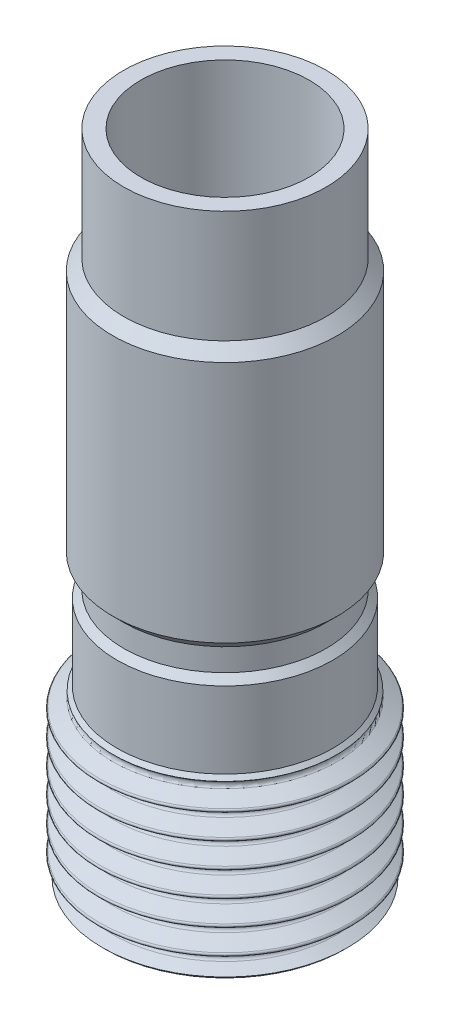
ISO-10303-21;
HEADER;
FILE_DESCRIPTION(('STEP AP214'),'2;1');
FILE_NAME('part.step','',(''),(''),'','','');
FILE_SCHEMA(('AUTOMOTIVE_DESIGN { 1 0 10303 214 1 1 1 1 }'));
ENDSEC;
DATA;
#1=APPLICATION_CONTEXT('core data for automotive mechanical design processes');
#2=APPLICATION_PROTOCOL_DEFINITION('international standard','automotive_design',2000,#1);
#3=PRODUCT_CONTEXT('',#1,'mechanical');
#4=PRODUCT('Part','Part','',(#3));
#5=PRODUCT_RELATED_PRODUCT_CATEGORY('part','',(#4));
#6=PRODUCT_DEFINITION_FORMATION('','',#4);
#7=PRODUCT_DEFINITION_CONTEXT('part definition',#1,'design');
#8=PRODUCT_DEFINITION('design','',#6,#7);
#9=PRODUCT_DEFINITION_SHAPE('','',#8);
#10=(LENGTH_UNIT() NAMED_UNIT(*) SI_UNIT(.MILLI.,.METRE.));
#11=(NAMED_UNIT(*) PLANE_ANGLE_UNIT() SI_UNIT($,.RADIAN.));
#12=(NAMED_UNIT(*) SI_UNIT($,.STERADIAN.) SOLID_ANGLE_UNIT());
#13=UNCERTAINTY_MEASURE_WITH_UNIT(LENGTH_MEASURE(1.E-05),#10,'distance_accuracy_value','');
#14=(GEOMETRIC_REPRESENTATION_CONTEXT(3) GLOBAL_UNCERTAINTY_ASSIGNED_CONTEXT((#13)) GLOBAL_UNIT_ASSIGNED_CONTEXT((#10,
#11,#12)) REPRESENTATION_CONTEXT('',''));
#15=CARTESIAN_POINT('',(0.,0.,0.));
#16=DIRECTION('',(0.,0.,1.));
#17=DIRECTION('',(1.,0.,0.));
#18=AXIS2_PLACEMENT_3D('',#15,#16,#17);
#19=CARTESIAN_POINT('',(-4.7625,0.,0.));
#20=DIRECTION('',(0.,1.,0.));
#21=DIRECTION('',(0.,0.,1.));
#22=AXIS2_PLACEMENT_3D('',#19,#20,#21);
#23=PLANE('',#22);
#24=CARTESIAN_POINT('',(0.,0.,0.));
#25=DIRECTION('',(0.,1.,0.));
#26=DIRECTION('',(0.,0.,1.));
#27=AXIS2_PLACEMENT_3D('',#24,#25,#26);
#28=CIRCLE('',#27,6.76275000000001);
#29=CARTESIAN_POINT('',(0.,0.,6.76275000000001));
#30=VERTEX_POINT('',#29);
#31=EDGE_CURVE('E10',#30,#30,#28,.F.);
#32=ORIENTED_EDGE('',*,*,#31,.T.);
#33=EDGE_LOOP('',(#32));
#34=FACE_BOUND('',#33,.T.);
#35=CARTESIAN_POINT('',(0.,0.,0.));
#36=DIRECTION('',(0.,1.,0.));
#37=DIRECTION('',(0.,0.,1.));
#38=AXIS2_PLACEMENT_3D('',#35,#36,#37);
#39=CIRCLE('',#38,5.1435);
#40=CARTESIAN_POINT('',(0.,0.,5.1435));
#41=VERTEX_POINT('',#40);
#42=EDGE_CURVE('E43',#41,#41,#39,.T.);
#43=ORIENTED_EDGE('',*,*,#42,.T.);
#44=EDGE_LOOP('',(#43));
#45=FACE_BOUND('',#44,.T.);
#46=ADVANCED_FACE('F35',(#34,#45),#23,.F.);
#47=CARTESIAN_POINT('',(0.,9.525,0.));
#48=DIRECTION('',(0.,-1.,0.));
#49=DIRECTION('',(0.,0.,-1.));
#50=AXIS2_PLACEMENT_3D('',#47,#48,#49);
#51=CONICAL_SURFACE('',#50,6.1087,0.78539816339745);
#52=CARTESIAN_POINT('',(0.,9.31439498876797,0.));
#53=DIRECTION('',(0.,-1.,0.));
#54=DIRECTION('',(0.,0.,-1.));
#55=AXIS2_PLACEMENT_3D('',#52,#53,#54);
#56=CIRCLE('',#55,6.31930501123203);
#57=CARTESIAN_POINT('',(0.,9.31439498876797,-6.31930501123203));
#58=VERTEX_POINT('',#57);
#59=EDGE_CURVE('E52',#58,#58,#56,.F.);
#60=ORIENTED_EDGE('',*,*,#59,.T.);
#61=EDGE_LOOP('',(#60));
#62=FACE_BOUND('',#61,.T.);
#63=CARTESIAN_POINT('',(0.,9.525,0.));
#64=DIRECTION('',(0.,-1.,0.));
#65=DIRECTION('',(0.,0.,-1.));
#66=AXIS2_PLACEMENT_3D('',#63,#64,#65);
#67=CIRCLE('',#66,6.1087);
#68=CARTESIAN_POINT('',(0.,9.525,-6.1087));
#69=VERTEX_POINT('',#68);
#70=EDGE_CURVE('E48',#69,#69,#67,.T.);
#71=ORIENTED_EDGE('',*,*,#70,.T.);
#72=EDGE_LOOP('',(#71));
#73=FACE_BOUND('',#72,.T.);
#74=ADVANCED_FACE('F206',(#62,#73),#51,.T.);
#75=CARTESIAN_POINT('',(0.,0.,0.));
#76=DIRECTION('',(0.,-1.,0.));
#77=DIRECTION('',(0.,0.,-1.));
#78=AXIS2_PLACEMENT_3D('',#75,#76,#77);
#79=CYLINDRICAL_SURFACE('',#78,6.1087);
#80=ORIENTED_EDGE('',*,*,#70,.F.);
#81=EDGE_LOOP('',(#80));
#82=FACE_BOUND('',#81,.T.);
#83=CARTESIAN_POINT('',(0.,13.843,0.));
#84=DIRECTION('',(0.,-1.,0.));
#85=DIRECTION('',(0.,0.,-1.));
#86=AXIS2_PLACEMENT_3D('',#83,#84,#85);
#87=CIRCLE('',#86,6.1087);
#88=CARTESIAN_POINT('',(0.,13.843,-6.1087));
#89=VERTEX_POINT('',#88);
#90=EDGE_CURVE('E200',#89,#89,#87,.T.);
#91=ORIENTED_EDGE('',*,*,#90,.T.);
#92=EDGE_LOOP('',(#91));
#93=FACE_BOUND('',#92,.T.);
#94=ADVANCED_FACE('F208',(#82,#93),#79,.T.);
#95=CARTESIAN_POINT('',(0.,14.224,0.));
#96=DIRECTION('',(0.,-1.,0.));
#97=DIRECTION('',(0.,0.,-1.));
#98=AXIS2_PLACEMENT_3D('',#95,#96,#97);
#99=CONICAL_SURFACE('',#98,5.7277,0.785398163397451);
#100=ORIENTED_EDGE('',*,*,#90,.F.);
#101=EDGE_LOOP('',(#100));
#102=FACE_BOUND('',#101,.T.);
#103=CARTESIAN_POINT('',(0.,14.224,0.));
#104=DIRECTION('',(0.,-1.,0.));
#105=DIRECTION('',(0.,0.,-1.));
#106=AXIS2_PLACEMENT_3D('',#103,#104,#105);
#107=CIRCLE('',#106,5.7277);
#108=CARTESIAN_POINT('',(0.,14.224,-5.7277));
#109=VERTEX_POINT('',#108);
#110=EDGE_CURVE('E197',#109,#109,#107,.T.);
#111=ORIENTED_EDGE('',*,*,#110,.T.);
#112=EDGE_LOOP('',(#111));
#113=FACE_BOUND('',#112,.T.);
#114=ADVANCED_FACE('F211',(#102,#113),#99,.T.);
#115=CARTESIAN_POINT('',(0.,0.,0.));
#116=DIRECTION('',(0.,-1.,0.));
#117=DIRECTION('',(0.,0.,-1.));
#118=AXIS2_PLACEMENT_3D('',#115,#116,#117);
#119=CYLINDRICAL_SURFACE('',#118,5.7277);
#120=ORIENTED_EDGE('',*,*,#110,.F.);
#121=EDGE_LOOP('',(#120));
#122=FACE_BOUND('',#121,.T.);
#123=CARTESIAN_POINT('',(0.,15.494,0.));
#124=DIRECTION('',(0.,-1.,0.));
#125=DIRECTION('',(0.,0.,-1.));
#126=AXIS2_PLACEMENT_3D('',#123,#124,#125);
#127=CIRCLE('',#126,5.7277);
#128=CARTESIAN_POINT('',(0.,15.494,-5.7277));
#129=VERTEX_POINT('',#128);
#130=EDGE_CURVE('E194',#129,#129,#127,.T.);
#131=ORIENTED_EDGE('',*,*,#130,.T.);
#132=EDGE_LOOP('',(#131));
#133=FACE_BOUND('',#132,.T.);
#134=ADVANCED_FACE('F217',(#122,#133),#119,.T.);
#135=CARTESIAN_POINT('',(0.,16.1163,0.));
#136=DIRECTION('',(0.,1.,0.));
#137=DIRECTION('',(0.,0.,1.));
#138=AXIS2_PLACEMENT_3D('',#135,#136,#137);
#139=CONICAL_SURFACE('',#138,6.35,0.785398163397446);
#140=ORIENTED_EDGE('',*,*,#130,.F.);
#141=EDGE_LOOP('',(#140));
#142=FACE_BOUND('',#141,.T.);
#143=CARTESIAN_POINT('',(0.,16.1163,0.));
#144=DIRECTION('',(0.,-1.,0.));
#145=DIRECTION('',(0.,0.,-1.));
#146=AXIS2_PLACEMENT_3D('',#143,#144,#145);
#147=CIRCLE('',#146,6.35);
#148=CARTESIAN_POINT('',(0.,16.1163,-6.35));
#149=VERTEX_POINT('',#148);
#150=EDGE_CURVE('E191',#149,#149,#147,.T.);
#151=ORIENTED_EDGE('',*,*,#150,.T.);
#152=EDGE_LOOP('',(#151));
#153=FACE_BOUND('',#152,.T.);
#154=ADVANCED_FACE('F223',(#142,#153),#139,.T.);
#155=CARTESIAN_POINT('',(0.,0.,0.));
#156=DIRECTION('',(0.,-1.,0.));
#157=DIRECTION('',(0.,0.,-1.));
#158=AXIS2_PLACEMENT_3D('',#155,#156,#157);
#159=CYLINDRICAL_SURFACE('',#158,6.35);
#160=ORIENTED_EDGE('',*,*,#150,.F.);
#161=EDGE_LOOP('',(#160));
#162=FACE_BOUND('',#161,.T.);
#163=CARTESIAN_POINT('',(0.,29.8577,0.));
#164=DIRECTION('',(0.,-1.,0.));
#165=DIRECTION('',(0.,0.,-1.));
#166=AXIS2_PLACEMENT_3D('',#163,#164,#165);
#167=CIRCLE('',#166,6.35);
#168=CARTESIAN_POINT('',(0.,29.8577,-6.35));
#169=VERTEX_POINT('',#168);
#170=EDGE_CURVE('E188',#169,#169,#167,.T.);
#171=ORIENTED_EDGE('',*,*,#170,.T.);
#172=EDGE_LOOP('',(#171));
#173=FACE_BOUND('',#172,.T.);
#174=ADVANCED_FACE('F229',(#162,#173),#159,.T.);
#175=CARTESIAN_POINT('',(0.,30.48,0.));
#176=DIRECTION('',(0.,-1.,0.));
#177=DIRECTION('',(0.,0.,-1.));
#178=AXIS2_PLACEMENT_3D('',#175,#176,#177);
#179=CONICAL_SURFACE('',#178,5.7277,0.78539816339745);
#180=ORIENTED_EDGE('',*,*,#170,.F.);
#181=EDGE_LOOP('',(#180));
#182=FACE_BOUND('',#181,.T.);
#183=CARTESIAN_POINT('',(0.,30.48,0.));
#184=DIRECTION('',(0.,-1.,0.));
#185=DIRECTION('',(0.,0.,-1.));
#186=AXIS2_PLACEMENT_3D('',#183,#184,#185);
#187=CIRCLE('',#186,5.7277);
#188=CARTESIAN_POINT('',(0.,30.48,-5.7277));
#189=VERTEX_POINT('',#188);
#190=EDGE_CURVE('E185',#189,#189,#187,.T.);
#191=ORIENTED_EDGE('',*,*,#190,.T.);
#192=EDGE_LOOP('',(#191));
#193=FACE_BOUND('',#192,.T.);
#194=ADVANCED_FACE('F235',(#182,#193),#179,.T.);
#195=CARTESIAN_POINT('',(0.,0.,0.));
#196=DIRECTION('',(0.,-1.,0.));
#197=DIRECTION('',(0.,0.,-1.));
#198=AXIS2_PLACEMENT_3D('',#195,#196,#197);
#199=CYLINDRICAL_SURFACE('',#198,5.7277);
#200=ORIENTED_EDGE('',*,*,#190,.F.);
#201=EDGE_LOOP('',(#200));
#202=FACE_BOUND('',#201,.T.);
#203=CARTESIAN_POINT('',(0.,36.83,0.));
#204=DIRECTION('',(0.,-1.,0.));
#205=DIRECTION('',(0.,0.,-1.));
#206=AXIS2_PLACEMENT_3D('',#203,#204,#205);
#207=CIRCLE('',#206,5.7277);
#208=CARTESIAN_POINT('',(0.,36.83,-5.7277));
#209=VERTEX_POINT('',#208);
#210=EDGE_CURVE('E182',#209,#209,#207,.T.);
#211=ORIENTED_EDGE('',*,*,#210,.T.);
#212=EDGE_LOOP('',(#211));
#213=FACE_BOUND('',#212,.T.);
#214=ADVANCED_FACE('F241',(#202,#213),#199,.T.);
#215=CARTESIAN_POINT('',(-5.7277,36.83,0.));
#216=DIRECTION('',(0.,-1.,0.));
#217=DIRECTION('',(0.,0.,-1.));
#218=AXIS2_PLACEMENT_3D('',#215,#216,#217);
#219=PLANE('',#218);
#220=ORIENTED_EDGE('',*,*,#210,.F.);
#221=EDGE_LOOP('',(#220));
#222=FACE_BOUND('',#221,.T.);
#223=CARTESIAN_POINT('',(0.,36.83,0.));
#224=DIRECTION('',(0.,-1.,0.));
#225=DIRECTION('',(0.,0.,-1.));
#226=AXIS2_PLACEMENT_3D('',#223,#224,#225);
#227=CIRCLE('',#226,4.7625);
#228=CARTESIAN_POINT('',(0.,36.83,-4.7625));
#229=VERTEX_POINT('',#228);
#230=EDGE_CURVE('E179',#229,#229,#227,.T.);
#231=ORIENTED_EDGE('',*,*,#230,.T.);
#232=EDGE_LOOP('',(#231));
#233=FACE_BOUND('',#232,.T.);
#234=ADVANCED_FACE('F247',(#222,#233),#219,.F.);
#235=CARTESIAN_POINT('',(0.,0.,0.));
#236=DIRECTION('',(0.,-1.,0.));
#237=DIRECTION('',(0.,0.,-1.));
#238=AXIS2_PLACEMENT_3D('',#235,#236,#237);
#239=CYLINDRICAL_SURFACE('',#238,4.7625);
#240=ORIENTED_EDGE('',*,*,#230,.F.);
#241=EDGE_LOOP('',(#240));
#242=FACE_BOUND('',#241,.T.);
#243=CARTESIAN_POINT('',(0.,25.4,0.));
#244=DIRECTION('',(0.,-1.,0.));
#245=DIRECTION('',(0.,0.,-1.));
#246=AXIS2_PLACEMENT_3D('',#243,#244,#245);
#247=CIRCLE('',#246,4.7625);
#248=CARTESIAN_POINT('',(0.,25.4,-4.7625));
#249=VERTEX_POINT('',#248);
#250=EDGE_CURVE('E176',#249,#249,#247,.T.);
#251=ORIENTED_EDGE('',*,*,#250,.T.);
#252=EDGE_LOOP('',(#251));
#253=FACE_BOUND('',#252,.T.);
#254=ADVANCED_FACE('F253',(#242,#253),#239,.F.);
#255=CARTESIAN_POINT('',(0.,23.9959089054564,0.));
#256=DIRECTION('',(0.,1.,0.));
#257=DIRECTION('',(0.,0.,1.));
#258=AXIS2_PLACEMENT_3D('',#255,#256,#257);
#259=CONICAL_SURFACE('',#258,2.4257,1.02974425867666);
#260=ORIENTED_EDGE('',*,*,#250,.F.);
#261=EDGE_LOOP('',(#260));
#262=FACE_BOUND('',#261,.T.);
#263=CARTESIAN_POINT('',(0.,23.9959089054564,0.));
#264=DIRECTION('',(0.,-1.,0.));
#265=DIRECTION('',(0.,0.,-1.));
#266=AXIS2_PLACEMENT_3D('',#263,#264,#265);
#267=CIRCLE('',#266,2.4257);
#268=CARTESIAN_POINT('',(0.,23.9959089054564,-2.4257));
#269=VERTEX_POINT('',#268);
#270=EDGE_CURVE('E173',#269,#269,#267,.T.);
#271=ORIENTED_EDGE('',*,*,#270,.T.);
#272=EDGE_LOOP('',(#271));
#273=FACE_BOUND('',#272,.T.);
#274=ADVANCED_FACE('F259',(#262,#273),#259,.F.);
#275=CARTESIAN_POINT('',(0.,0.,0.));
#276=DIRECTION('',(0.,-1.,0.));
#277=DIRECTION('',(0.,0.,-1.));
#278=AXIS2_PLACEMENT_3D('',#275,#276,#277);
#279=CYLINDRICAL_SURFACE('',#278,2.4257);
#280=ORIENTED_EDGE('',*,*,#270,.F.);
#281=EDGE_LOOP('',(#280));
#282=FACE_BOUND('',#281,.T.);
#283=CARTESIAN_POINT('',(0.,15.875,0.));
#284=DIRECTION('',(0.,-1.,0.));
#285=DIRECTION('',(0.,0.,-1.));
#286=AXIS2_PLACEMENT_3D('',#283,#284,#285);
#287=CIRCLE('',#286,2.4257);
#288=CARTESIAN_POINT('',(0.,15.875,-2.4257));
#289=VERTEX_POINT('',#288);
#290=EDGE_CURVE('E170',#289,#289,#287,.T.);
#291=ORIENTED_EDGE('',*,*,#290,.T.);
#292=EDGE_LOOP('',(#291));
#293=FACE_BOUND('',#292,.T.);
#294=ADVANCED_FACE('F265',(#282,#293),#279,.F.);
#295=CARTESIAN_POINT('',(-4.7625,15.875,0.));
#296=DIRECTION('',(0.,1.,0.));
#297=DIRECTION('',(0.,0.,1.));
#298=AXIS2_PLACEMENT_3D('',#295,#296,#297);
#299=PLANE('',#298);
#300=ORIENTED_EDGE('',*,*,#290,.F.);
#301=EDGE_LOOP('',(#300));
#302=FACE_BOUND('',#301,.T.);
#303=CARTESIAN_POINT('',(0.,15.875,0.));
#304=DIRECTION('',(0.,-1.,0.));
#305=DIRECTION('',(0.,0.,-1.));
#306=AXIS2_PLACEMENT_3D('',#303,#304,#305);
#307=CIRCLE('',#306,4.7625);
#308=CARTESIAN_POINT('',(0.,15.875,-4.7625));
#309=VERTEX_POINT('',#308);
#310=EDGE_CURVE('E56',#309,#309,#307,.T.);
#311=ORIENTED_EDGE('',*,*,#310,.T.);
#312=EDGE_LOOP('',(#311));
#313=FACE_BOUND('',#312,.T.);
#314=ADVANCED_FACE('F271',(#302,#313),#299,.F.);
#315=CARTESIAN_POINT('',(0.,0.,0.));
#316=DIRECTION('',(0.,-1.,0.));
#317=DIRECTION('',(0.,0.,-1.));
#318=AXIS2_PLACEMENT_3D('',#315,#316,#317);
#319=CYLINDRICAL_SURFACE('',#318,4.7625);
#320=CARTESIAN_POINT('',(0.,6.89992613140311,0.));
#321=DIRECTION('',(0.,-1.,0.));
#322=DIRECTION('',(0.,0.,-1.));
#323=AXIS2_PLACEMENT_3D('',#320,#321,#322);
#324=CIRCLE('',#323,4.7625);
#325=CARTESIAN_POINT('',(0.,6.89992613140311,-4.7625));
#326=VERTEX_POINT('',#325);
#327=EDGE_CURVE('E62',#326,#326,#324,.T.);
#328=ORIENTED_EDGE('',*,*,#327,.T.);
#329=EDGE_LOOP('',(#328));
#330=FACE_BOUND('',#329,.T.);
#331=ORIENTED_EDGE('',*,*,#310,.F.);
#332=EDGE_LOOP('',(#331));
#333=FACE_BOUND('',#332,.T.);
#334=ADVANCED_FACE('F277',(#330,#333),#319,.F.);
#335=CARTESIAN_POINT('',(0.,0.,0.));
#336=DIRECTION('',(0.,1.,0.));
#337=DIRECTION('',(0.,0.,1.));
#338=AXIS2_PLACEMENT_3D('',#335,#336,#337);
#339=CONICAL_SURFACE('',#338,6.76275000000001,0.785398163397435);
#340=CARTESIAN_POINT('',(0.,0.158838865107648,0.));
#341=DIRECTION('',(0.,-1.,0.));
#342=DIRECTION('',(1.,0.,0.));
#343=AXIS2_PLACEMENT_3D('',#340,#341,#342);
#344=CIRCLE('',#343,6.92158886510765);
#345=CARTESIAN_POINT('',(6.92158886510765,0.158838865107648,0.));
#346=VERTEX_POINT('',#345);
#347=EDGE_CURVE('E58',#346,#346,#344,.F.);
#348=ORIENTED_EDGE('',*,*,#347,.F.);
#349=EDGE_LOOP('',(#348));
#350=FACE_BOUND('',#349,.T.);
#351=ORIENTED_EDGE('',*,*,#31,.F.);
#352=EDGE_LOOP('',(#351));
#353=FACE_BOUND('',#352,.T.);
#354=ADVANCED_FACE('F282',(#350,#353),#339,.T.);
#355=CARTESIAN_POINT('',(0.,0.381000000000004,0.));
#356=DIRECTION('',(0.,-1.,0.));
#357=DIRECTION('',(0.,0.,-1.));
#358=AXIS2_PLACEMENT_3D('',#355,#356,#357);
#359=CONICAL_SURFACE('',#358,4.7625,0.785398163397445);
#360=CARTESIAN_POINT('',(0.,0.0584830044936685,0.));
#361=DIRECTION('',(0.,-1.,0.));
#362=DIRECTION('',(0.,0.,-1.));
#363=AXIS2_PLACEMENT_3D('',#360,#361,#362);
#364=CIRCLE('',#363,5.08501699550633);
#365=CARTESIAN_POINT('',(0.,0.0584830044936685,-5.08501699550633));
#366=VERTEX_POINT('',#365);
#367=EDGE_CURVE('E39',#366,#366,#364,.T.);
#368=ORIENTED_EDGE('',*,*,#367,.F.);
#369=EDGE_LOOP('',(#368));
#370=FACE_BOUND('',#369,.T.);
#371=ORIENTED_EDGE('',*,*,#42,.F.);
#372=EDGE_LOOP('',(#371));
#373=FACE_BOUND('',#372,.T.);
#374=ADVANCED_FACE('F37',(#370,#373),#359,.F.);
#375=CARTESIAN_POINT('',(0.,9.144,0.));
#376=DIRECTION('',(0.,1.,0.));
#377=DIRECTION('',(-1.,0.,0.));
#378=AXIS2_PLACEMENT_3D('',#375,#376,#377);
#379=TOROIDAL_SURFACE('',#378,6.43088279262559,0.203676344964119);
#380=CARTESIAN_POINT('',(0.,8.96761111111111,0.));
#381=DIRECTION('',(0.,1.,0.));
#382=DIRECTION('',(-1.,0.,0.));
#383=AXIS2_PLACEMENT_3D('',#380,#381,#382);
#384=CIRCLE('',#383,6.32904462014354);
#385=CARTESIAN_POINT('',(-6.32904462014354,8.96761111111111,0.));
#386=VERTEX_POINT('',#385);
#387=EDGE_CURVE('E57',#386,#386,#384,.T.);
#388=ORIENTED_EDGE('',*,*,#387,.T.);
#389=EDGE_LOOP('',(#388));
#390=FACE_BOUND('',#389,.T.);
#391=ORIENTED_EDGE('',*,*,#59,.F.);
#392=EDGE_LOOP('',(#391));
#393=FACE_BOUND('',#392,.T.);
#394=ADVANCED_FACE('F300',(#390,#393),#379,.F.);
#395=CARTESIAN_POINT('',(0.,8.52663888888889,0.));
#396=DIRECTION('',(0.,-1.,0.));
#397=DIRECTION('',(1.,0.,0.));
#398=AXIS2_PLACEMENT_3D('',#395,#396,#397);
#399=CONICAL_SURFACE('',#398,7.09283091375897,1.04719755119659);
#400=ORIENTED_EDGE('',*,*,#387,.F.);
#401=EDGE_LOOP('',(#400));
#402=FACE_BOUND('',#401,.T.);
#403=CARTESIAN_POINT('',(0.,8.52663888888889,0.));
#404=DIRECTION('',(0.,1.,0.));
#405=DIRECTION('',(-1.,0.,0.));
#406=AXIS2_PLACEMENT_3D('',#403,#404,#405);
#407=CIRCLE('',#406,7.09283091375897);
#408=CARTESIAN_POINT('',(-7.09283091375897,8.52663888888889,0.));
#409=VERTEX_POINT('',#408);
#410=EDGE_CURVE('E161',#409,#409,#407,.T.);
#411=ORIENTED_EDGE('',*,*,#410,.T.);
#412=EDGE_LOOP('',(#411));
#413=FACE_BOUND('',#412,.T.);
#414=ADVANCED_FACE('F305',(#402,#413),#399,.T.);
#415=CARTESIAN_POINT('',(0.,8.43844444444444,0.));
#416=DIRECTION('',(0.,1.,0.));
#417=DIRECTION('',(-1.,0.,0.));
#418=AXIS2_PLACEMENT_3D('',#415,#416,#417);
#419=TOROIDAL_SURFACE('',#418,7.04191182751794,0.10183817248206);
#420=ORIENTED_EDGE('',*,*,#410,.F.);
#421=EDGE_LOOP('',(#420));
#422=FACE_BOUND('',#421,.T.);
#423=CARTESIAN_POINT('',(0.,8.35025,0.));
#424=DIRECTION('',(0.,1.,0.));
#425=DIRECTION('',(-1.,0.,0.));
#426=AXIS2_PLACEMENT_3D('',#423,#424,#425);
#427=CIRCLE('',#426,7.09283091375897);
#428=CARTESIAN_POINT('',(-7.09283091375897,8.35025,0.));
#429=VERTEX_POINT('',#428);
#430=EDGE_CURVE('E149',#429,#429,#427,.T.);
#431=ORIENTED_EDGE('',*,*,#430,.T.);
#432=EDGE_LOOP('',(#431));
#433=FACE_BOUND('',#432,.T.);
#434=ADVANCED_FACE('F532',(#422,#433),#419,.T.);
#435=CARTESIAN_POINT('',(0.,7.73288888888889,0.));
#436=DIRECTION('',(0.,1.,0.));
#437=DIRECTION('',(-1.,0.,0.));
#438=AXIS2_PLACEMENT_3D('',#435,#436,#437);
#439=TOROIDAL_SURFACE('',#438,6.43088279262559,0.203676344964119);
#440=CARTESIAN_POINT('',(0.,7.90927777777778,0.));
#441=DIRECTION('',(0.,1.,0.));
#442=DIRECTION('',(-1.,0.,0.));
#443=AXIS2_PLACEMENT_3D('',#440,#441,#442);
#444=CIRCLE('',#443,6.32904462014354);
#445=CARTESIAN_POINT('',(-6.32904462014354,7.90927777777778,0.));
#446=VERTEX_POINT('',#445);
#447=EDGE_CURVE('E145',#446,#446,#444,.T.);
#448=ORIENTED_EDGE('',*,*,#447,.F.);
#449=EDGE_LOOP('',(#448));
#450=FACE_BOUND('',#449,.T.);
#451=CARTESIAN_POINT('',(0.,7.5565,0.));
#452=DIRECTION('',(0.,1.,0.));
#453=DIRECTION('',(-1.,0.,0.));
#454=AXIS2_PLACEMENT_3D('',#451,#452,#453);
#455=CIRCLE('',#454,6.32904462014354);
#456=CARTESIAN_POINT('',(-6.32904462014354,7.5565,0.));
#457=VERTEX_POINT('',#456);
#458=EDGE_CURVE('E157',#457,#457,#455,.T.);
#459=ORIENTED_EDGE('',*,*,#458,.T.);
#460=EDGE_LOOP('',(#459));
#461=FACE_BOUND('',#460,.T.);
#462=ADVANCED_FACE('F528',(#450,#461),#439,.F.);
#463=CARTESIAN_POINT('',(0.,7.11552777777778,0.));
#464=DIRECTION('',(0.,-1.,0.));
#465=DIRECTION('',(1.,0.,0.));
#466=AXIS2_PLACEMENT_3D('',#463,#464,#465);
#467=CONICAL_SURFACE('',#466,7.09283091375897,1.04719755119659);
#468=ORIENTED_EDGE('',*,*,#458,.F.);
#469=EDGE_LOOP('',(#468));
#470=FACE_BOUND('',#469,.T.);
#471=CARTESIAN_POINT('',(0.,7.11552777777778,0.));
#472=DIRECTION('',(0.,1.,0.));
#473=DIRECTION('',(-1.,0.,0.));
#474=AXIS2_PLACEMENT_3D('',#471,#472,#473);
#475=CIRCLE('',#474,7.09283091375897);
#476=CARTESIAN_POINT('',(-7.09283091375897,7.11552777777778,0.));
#477=VERTEX_POINT('',#476);
#478=EDGE_CURVE('E153',#477,#477,#475,.T.);
#479=ORIENTED_EDGE('',*,*,#478,.T.);
#480=EDGE_LOOP('',(#479));
#481=FACE_BOUND('',#480,.T.);
#482=ADVANCED_FACE('F524',(#470,#481),#467,.T.);
#483=CARTESIAN_POINT('',(0.,7.02733333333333,0.));
#484=DIRECTION('',(0.,1.,0.));
#485=DIRECTION('',(-1.,0.,0.));
#486=AXIS2_PLACEMENT_3D('',#483,#484,#485);
#487=TOROIDAL_SURFACE('',#486,7.04191182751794,0.10183817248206);
#488=ORIENTED_EDGE('',*,*,#478,.F.);
#489=EDGE_LOOP('',(#488));
#490=FACE_BOUND('',#489,.T.);
#491=CARTESIAN_POINT('',(0.,6.93913888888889,0.));
#492=DIRECTION('',(0.,1.,0.));
#493=DIRECTION('',(-1.,0.,0.));
#494=AXIS2_PLACEMENT_3D('',#491,#492,#493);
#495=CIRCLE('',#494,7.09283091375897);
#496=CARTESIAN_POINT('',(-7.09283091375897,6.93913888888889,0.));
#497=VERTEX_POINT('',#496);
#498=EDGE_CURVE('E133',#497,#497,#495,.T.);
#499=ORIENTED_EDGE('',*,*,#498,.T.);
#500=EDGE_LOOP('',(#499));
#501=FACE_BOUND('',#500,.T.);
#502=ADVANCED_FACE('F520',(#490,#501),#487,.T.);
#503=CARTESIAN_POINT('',(0.,7.90927777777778,0.));
#504=DIRECTION('',(0.,1.,0.));
#505=DIRECTION('',(-1.,0.,0.));
#506=AXIS2_PLACEMENT_3D('',#503,#504,#505);
#507=CONICAL_SURFACE('',#506,6.32904462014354,1.04719755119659);
#508=ORIENTED_EDGE('',*,*,#430,.F.);
#509=EDGE_LOOP('',(#508));
#510=FACE_BOUND('',#509,.T.);
#511=ORIENTED_EDGE('',*,*,#447,.T.);
#512=EDGE_LOOP('',(#511));
#513=FACE_BOUND('',#512,.T.);
#514=ADVANCED_FACE('F516',(#510,#513),#507,.T.);
#515=CARTESIAN_POINT('',(0.,6.32177777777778,0.));
#516=DIRECTION('',(0.,1.,0.));
#517=DIRECTION('',(-1.,0.,0.));
#518=AXIS2_PLACEMENT_3D('',#515,#516,#517);
#519=TOROIDAL_SURFACE('',#518,6.43088279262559,0.203676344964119);
#520=CARTESIAN_POINT('',(0.,6.49816666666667,0.));
#521=DIRECTION('',(0.,1.,0.));
#522=DIRECTION('',(-1.,0.,0.));
#523=AXIS2_PLACEMENT_3D('',#520,#521,#522);
#524=CIRCLE('',#523,6.32904462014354);
#525=CARTESIAN_POINT('',(-6.32904462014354,6.49816666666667,0.));
#526=VERTEX_POINT('',#525);
#527=EDGE_CURVE('E129',#526,#526,#524,.T.);
#528=ORIENTED_EDGE('',*,*,#527,.F.);
#529=EDGE_LOOP('',(#528));
#530=FACE_BOUND('',#529,.T.);
#531=CARTESIAN_POINT('',(0.,6.14538888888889,0.));
#532=DIRECTION('',(0.,1.,0.));
#533=DIRECTION('',(-1.,0.,0.));
#534=AXIS2_PLACEMENT_3D('',#531,#532,#533);
#535=CIRCLE('',#534,6.32904462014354);
#536=CARTESIAN_POINT('',(-6.32904462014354,6.14538888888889,0.));
#537=VERTEX_POINT('',#536);
#538=EDGE_CURVE('E141',#537,#537,#535,.T.);
#539=ORIENTED_EDGE('',*,*,#538,.T.);
#540=EDGE_LOOP('',(#539));
#541=FACE_BOUND('',#540,.T.);
#542=ADVANCED_FACE('F512',(#530,#541),#519,.F.);
#543=CARTESIAN_POINT('',(0.,5.70441666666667,0.));
#544=DIRECTION('',(0.,-1.,0.));
#545=DIRECTION('',(1.,0.,0.));
#546=AXIS2_PLACEMENT_3D('',#543,#544,#545);
#547=CONICAL_SURFACE('',#546,7.09283091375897,1.04719755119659);
#548=ORIENTED_EDGE('',*,*,#538,.F.);
#549=EDGE_LOOP('',(#548));
#550=FACE_BOUND('',#549,.T.);
#551=CARTESIAN_POINT('',(0.,5.70441666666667,0.));
#552=DIRECTION('',(0.,1.,0.));
#553=DIRECTION('',(-1.,0.,0.));
#554=AXIS2_PLACEMENT_3D('',#551,#552,#553);
#555=CIRCLE('',#554,7.09283091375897);
#556=CARTESIAN_POINT('',(-7.09283091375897,5.70441666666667,0.));
#557=VERTEX_POINT('',#556);
#558=EDGE_CURVE('E137',#557,#557,#555,.T.);
#559=ORIENTED_EDGE('',*,*,#558,.T.);
#560=EDGE_LOOP('',(#559));
#561=FACE_BOUND('',#560,.T.);
#562=ADVANCED_FACE('F508',(#550,#561),#547,.T.);
#563=CARTESIAN_POINT('',(0.,5.61622222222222,0.));
#564=DIRECTION('',(0.,1.,0.));
#565=DIRECTION('',(-1.,0.,0.));
#566=AXIS2_PLACEMENT_3D('',#563,#564,#565);
#567=TOROIDAL_SURFACE('',#566,7.04191182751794,0.10183817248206);
#568=ORIENTED_EDGE('',*,*,#558,.F.);
#569=EDGE_LOOP('',(#568));
#570=FACE_BOUND('',#569,.T.);
#571=CARTESIAN_POINT('',(0.,5.52802777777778,0.));
#572=DIRECTION('',(0.,1.,0.));
#573=DIRECTION('',(-1.,0.,0.));
#574=AXIS2_PLACEMENT_3D('',#571,#572,#573);
#575=CIRCLE('',#574,7.09283091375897);
#576=CARTESIAN_POINT('',(-7.09283091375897,5.52802777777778,0.));
#577=VERTEX_POINT('',#576);
#578=EDGE_CURVE('E117',#577,#577,#575,.T.);
#579=ORIENTED_EDGE('',*,*,#578,.T.);
#580=EDGE_LOOP('',(#579));
#581=FACE_BOUND('',#580,.T.);
#582=ADVANCED_FACE('F504',(#570,#581),#567,.T.);
#583=CARTESIAN_POINT('',(0.,6.49816666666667,0.));
#584=DIRECTION('',(0.,1.,0.));
#585=DIRECTION('',(-1.,0.,0.));
#586=AXIS2_PLACEMENT_3D('',#583,#584,#585);
#587=CONICAL_SURFACE('',#586,6.32904462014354,1.04719755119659);
#588=ORIENTED_EDGE('',*,*,#498,.F.);
#589=EDGE_LOOP('',(#588));
#590=FACE_BOUND('',#589,.T.);
#591=ORIENTED_EDGE('',*,*,#527,.T.);
#592=EDGE_LOOP('',(#591));
#593=FACE_BOUND('',#592,.T.);
#594=ADVANCED_FACE('F500',(#590,#593),#587,.T.);
#595=CARTESIAN_POINT('',(0.,4.91066666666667,0.));
#596=DIRECTION('',(0.,1.,0.));
#597=DIRECTION('',(-1.,0.,0.));
#598=AXIS2_PLACEMENT_3D('',#595,#596,#597);
#599=TOROIDAL_SURFACE('',#598,6.43088279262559,0.203676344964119);
#600=CARTESIAN_POINT('',(0.,5.08705555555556,0.));
#601=DIRECTION('',(0.,1.,0.));
#602=DIRECTION('',(-1.,0.,0.));
#603=AXIS2_PLACEMENT_3D('',#600,#601,#602);
#604=CIRCLE('',#603,6.32904462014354);
#605=CARTESIAN_POINT('',(-6.32904462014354,5.08705555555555,0.));
#606=VERTEX_POINT('',#605);
#607=EDGE_CURVE('E113',#606,#606,#604,.T.);
#608=ORIENTED_EDGE('',*,*,#607,.F.);
#609=EDGE_LOOP('',(#608));
#610=FACE_BOUND('',#609,.T.);
#611=CARTESIAN_POINT('',(0.,4.73427777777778,0.));
#612=DIRECTION('',(0.,1.,0.));
#613=DIRECTION('',(-1.,0.,0.));
#614=AXIS2_PLACEMENT_3D('',#611,#612,#613);
#615=CIRCLE('',#614,6.32904462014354);
#616=CARTESIAN_POINT('',(-6.32904462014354,4.73427777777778,0.));
#617=VERTEX_POINT('',#616);
#618=EDGE_CURVE('E125',#617,#617,#615,.T.);
#619=ORIENTED_EDGE('',*,*,#618,.T.);
#620=EDGE_LOOP('',(#619));
#621=FACE_BOUND('',#620,.T.);
#622=ADVANCED_FACE('F496',(#610,#621),#599,.F.);
#623=CARTESIAN_POINT('',(0.,4.29330555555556,0.));
#624=DIRECTION('',(0.,-1.,0.));
#625=DIRECTION('',(1.,0.,0.));
#626=AXIS2_PLACEMENT_3D('',#623,#624,#625);
#627=CONICAL_SURFACE('',#626,7.09283091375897,1.04719755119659);
#628=ORIENTED_EDGE('',*,*,#618,.F.);
#629=EDGE_LOOP('',(#628));
#630=FACE_BOUND('',#629,.T.);
#631=CARTESIAN_POINT('',(0.,4.29330555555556,0.));
#632=DIRECTION('',(0.,1.,0.));
#633=DIRECTION('',(-1.,0.,0.));
#634=AXIS2_PLACEMENT_3D('',#631,#632,#633);
#635=CIRCLE('',#634,7.09283091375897);
#636=CARTESIAN_POINT('',(-7.09283091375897,4.29330555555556,0.));
#637=VERTEX_POINT('',#636);
#638=EDGE_CURVE('E121',#637,#637,#635,.T.);
#639=ORIENTED_EDGE('',*,*,#638,.T.);
#640=EDGE_LOOP('',(#639));
#641=FACE_BOUND('',#640,.T.);
#642=ADVANCED_FACE('F492',(#630,#641),#627,.T.);
#643=CARTESIAN_POINT('',(0.,4.20511111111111,0.));
#644=DIRECTION('',(0.,1.,0.));
#645=DIRECTION('',(-1.,0.,0.));
#646=AXIS2_PLACEMENT_3D('',#643,#644,#645);
#647=TOROIDAL_SURFACE('',#646,7.04191182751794,0.10183817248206);
#648=ORIENTED_EDGE('',*,*,#638,.F.);
#649=EDGE_LOOP('',(#648));
#650=FACE_BOUND('',#649,.T.);
#651=CARTESIAN_POINT('',(0.,4.11691666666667,0.));
#652=DIRECTION('',(0.,1.,0.));
#653=DIRECTION('',(-1.,0.,0.));
#654=AXIS2_PLACEMENT_3D('',#651,#652,#653);
#655=CIRCLE('',#654,7.09283091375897);
#656=CARTESIAN_POINT('',(-7.09283091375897,4.11691666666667,0.));
#657=VERTEX_POINT('',#656);
#658=EDGE_CURVE('E103',#657,#657,#655,.T.);
#659=ORIENTED_EDGE('',*,*,#658,.T.);
#660=EDGE_LOOP('',(#659));
#661=FACE_BOUND('',#660,.T.);
#662=ADVANCED_FACE('F488',(#650,#661),#647,.T.);
#663=CARTESIAN_POINT('',(0.,5.08705555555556,0.));
#664=DIRECTION('',(0.,1.,0.));
#665=DIRECTION('',(-1.,0.,0.));
#666=AXIS2_PLACEMENT_3D('',#663,#664,#665);
#667=CONICAL_SURFACE('',#666,6.32904462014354,1.04719755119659);
#668=ORIENTED_EDGE('',*,*,#578,.F.);
#669=EDGE_LOOP('',(#668));
#670=FACE_BOUND('',#669,.T.);
#671=ORIENTED_EDGE('',*,*,#607,.T.);
#672=EDGE_LOOP('',(#671));
#673=FACE_BOUND('',#672,.T.);
#674=ADVANCED_FACE('F484',(#670,#673),#667,.T.);
#675=CARTESIAN_POINT('',(0.,3.49955555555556,0.));
#676=DIRECTION('',(0.,1.,0.));
#677=DIRECTION('',(-1.,0.,0.));
#678=AXIS2_PLACEMENT_3D('',#675,#676,#677);
#679=TOROIDAL_SURFACE('',#678,6.43088279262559,0.203676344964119);
#680=CARTESIAN_POINT('',(0.,3.67594444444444,0.));
#681=DIRECTION('',(0.,1.,0.));
#682=DIRECTION('',(-1.,0.,0.));
#683=AXIS2_PLACEMENT_3D('',#680,#681,#682);
#684=CIRCLE('',#683,6.32904462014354);
#685=CARTESIAN_POINT('',(-6.32904462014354,3.67594444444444,0.));
#686=VERTEX_POINT('',#685);
#687=EDGE_CURVE('E100',#686,#686,#684,.T.);
#688=ORIENTED_EDGE('',*,*,#687,.F.);
#689=EDGE_LOOP('',(#688));
#690=FACE_BOUND('',#689,.T.);
#691=CARTESIAN_POINT('',(0.,3.32316666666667,0.));
#692=DIRECTION('',(0.,1.,0.));
#693=DIRECTION('',(-1.,0.,0.));
#694=AXIS2_PLACEMENT_3D('',#691,#692,#693);
#695=CIRCLE('',#694,6.32904462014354);
#696=CARTESIAN_POINT('',(-6.32904462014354,3.32316666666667,0.));
#697=VERTEX_POINT('',#696);
#698=EDGE_CURVE('E110',#697,#697,#695,.T.);
#699=ORIENTED_EDGE('',*,*,#698,.T.);
#700=EDGE_LOOP('',(#699));
#701=FACE_BOUND('',#700,.T.);
#702=ADVANCED_FACE('F480',(#690,#701),#679,.F.);
#703=CARTESIAN_POINT('',(0.,2.88219444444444,0.));
#704=DIRECTION('',(0.,-1.,0.));
#705=DIRECTION('',(1.,0.,0.));
#706=AXIS2_PLACEMENT_3D('',#703,#704,#705);
#707=CONICAL_SURFACE('',#706,7.09283091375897,1.04719755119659);
#708=ORIENTED_EDGE('',*,*,#698,.F.);
#709=EDGE_LOOP('',(#708));
#710=FACE_BOUND('',#709,.T.);
#711=CARTESIAN_POINT('',(0.,2.88219444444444,0.));
#712=DIRECTION('',(0.,1.,0.));
#713=DIRECTION('',(-1.,0.,0.));
#714=AXIS2_PLACEMENT_3D('',#711,#712,#713);
#715=CIRCLE('',#714,7.09283091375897);
#716=CARTESIAN_POINT('',(-7.09283091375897,2.88219444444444,0.));
#717=VERTEX_POINT('',#716);
#718=EDGE_CURVE('E107',#717,#717,#715,.T.);
#719=ORIENTED_EDGE('',*,*,#718,.T.);
#720=EDGE_LOOP('',(#719));
#721=FACE_BOUND('',#720,.T.);
#722=ADVANCED_FACE('F476',(#710,#721),#707,.T.);
#723=CARTESIAN_POINT('',(0.,2.794,0.));
#724=DIRECTION('',(0.,1.,0.));
#725=DIRECTION('',(-1.,0.,0.));
#726=AXIS2_PLACEMENT_3D('',#723,#724,#725);
#727=TOROIDAL_SURFACE('',#726,7.04191182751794,0.10183817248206);
#728=ORIENTED_EDGE('',*,*,#718,.F.);
#729=EDGE_LOOP('',(#728));
#730=FACE_BOUND('',#729,.T.);
#731=CARTESIAN_POINT('',(0.,2.70580555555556,0.));
#732=DIRECTION('',(0.,1.,0.));
#733=DIRECTION('',(-1.,0.,0.));
#734=AXIS2_PLACEMENT_3D('',#731,#732,#733);
#735=CIRCLE('',#734,7.09283091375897);
#736=CARTESIAN_POINT('',(-7.09283091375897,2.70580555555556,0.));
#737=VERTEX_POINT('',#736);
#738=EDGE_CURVE('E91',#737,#737,#735,.T.);
#739=ORIENTED_EDGE('',*,*,#738,.T.);
#740=EDGE_LOOP('',(#739));
#741=FACE_BOUND('',#740,.T.);
#742=ADVANCED_FACE('F472',(#730,#741),#727,.T.);
#743=CARTESIAN_POINT('',(0.,3.67594444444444,0.));
#744=DIRECTION('',(0.,1.,0.));
#745=DIRECTION('',(-1.,0.,0.));
#746=AXIS2_PLACEMENT_3D('',#743,#744,#745);
#747=CONICAL_SURFACE('',#746,6.32904462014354,1.04719755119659);
#748=ORIENTED_EDGE('',*,*,#658,.F.);
#749=EDGE_LOOP('',(#748));
#750=FACE_BOUND('',#749,.T.);
#751=ORIENTED_EDGE('',*,*,#687,.T.);
#752=EDGE_LOOP('',(#751));
#753=FACE_BOUND('',#752,.T.);
#754=ADVANCED_FACE('F468',(#750,#753),#747,.T.);
#755=CARTESIAN_POINT('',(0.,2.08844444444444,0.));
#756=DIRECTION('',(0.,1.,0.));
#757=DIRECTION('',(-1.,0.,0.));
#758=AXIS2_PLACEMENT_3D('',#755,#756,#757);
#759=TOROIDAL_SURFACE('',#758,6.43088279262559,0.203676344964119);
#760=CARTESIAN_POINT('',(0.,2.26483333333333,0.));
#761=DIRECTION('',(0.,1.,0.));
#762=DIRECTION('',(-1.,0.,0.));
#763=AXIS2_PLACEMENT_3D('',#760,#761,#762);
#764=CIRCLE('',#763,6.32904462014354);
#765=CARTESIAN_POINT('',(-6.32904462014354,2.26483333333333,0.));
#766=VERTEX_POINT('',#765);
#767=EDGE_CURVE('E60',#766,#766,#764,.T.);
#768=ORIENTED_EDGE('',*,*,#767,.F.);
#769=EDGE_LOOP('',(#768));
#770=FACE_BOUND('',#769,.T.);
#771=CARTESIAN_POINT('',(0.,1.91205555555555,0.));
#772=DIRECTION('',(0.,1.,0.));
#773=DIRECTION('',(-1.,0.,0.));
#774=AXIS2_PLACEMENT_3D('',#771,#772,#773);
#775=CIRCLE('',#774,6.32904462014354);
#776=CARTESIAN_POINT('',(-6.32904462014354,1.91205555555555,0.));
#777=VERTEX_POINT('',#776);
#778=EDGE_CURVE('E97',#777,#777,#775,.T.);
#779=ORIENTED_EDGE('',*,*,#778,.T.);
#780=EDGE_LOOP('',(#779));
#781=FACE_BOUND('',#780,.T.);
#782=ADVANCED_FACE('F464',(#770,#781),#759,.F.);
#783=CARTESIAN_POINT('',(0.,1.47108333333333,0.));
#784=DIRECTION('',(0.,-1.,0.));
#785=DIRECTION('',(1.,0.,0.));
#786=AXIS2_PLACEMENT_3D('',#783,#784,#785);
#787=CONICAL_SURFACE('',#786,7.09283091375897,1.04719755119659);
#788=ORIENTED_EDGE('',*,*,#778,.F.);
#789=EDGE_LOOP('',(#788));
#790=FACE_BOUND('',#789,.T.);
#791=CARTESIAN_POINT('',(0.,1.47108333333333,0.));
#792=DIRECTION('',(0.,1.,0.));
#793=DIRECTION('',(-1.,0.,0.));
#794=AXIS2_PLACEMENT_3D('',#791,#792,#793);
#795=CIRCLE('',#794,7.09283091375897);
#796=CARTESIAN_POINT('',(-7.09283091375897,1.47108333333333,0.));
#797=VERTEX_POINT('',#796);
#798=EDGE_CURVE('E94',#797,#797,#795,.T.);
#799=ORIENTED_EDGE('',*,*,#798,.T.);
#800=EDGE_LOOP('',(#799));
#801=FACE_BOUND('',#800,.T.);
#802=ADVANCED_FACE('F460',(#790,#801),#787,.T.);
#803=CARTESIAN_POINT('',(0.,1.38288888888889,0.));
#804=DIRECTION('',(0.,1.,0.));
#805=DIRECTION('',(-1.,0.,0.));
#806=AXIS2_PLACEMENT_3D('',#803,#804,#805);
#807=TOROIDAL_SURFACE('',#806,7.04191182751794,0.10183817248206);
#808=ORIENTED_EDGE('',*,*,#798,.F.);
#809=EDGE_LOOP('',(#808));
#810=FACE_BOUND('',#809,.T.);
#811=CARTESIAN_POINT('',(0.,1.29469444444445,0.));
#812=DIRECTION('',(0.,1.,0.));
#813=DIRECTION('',(-1.,0.,0.));
#814=AXIS2_PLACEMENT_3D('',#811,#812,#813);
#815=CIRCLE('',#814,7.09283091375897);
#816=CARTESIAN_POINT('',(-7.09283091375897,1.29469444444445,0.));
#817=VERTEX_POINT('',#816);
#818=EDGE_CURVE('E71',#817,#817,#815,.T.);
#819=ORIENTED_EDGE('',*,*,#818,.T.);
#820=EDGE_LOOP('',(#819));
#821=FACE_BOUND('',#820,.T.);
#822=ADVANCED_FACE('F456',(#810,#821),#807,.T.);
#823=CARTESIAN_POINT('',(0.,2.26483333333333,0.));
#824=DIRECTION('',(0.,1.,0.));
#825=DIRECTION('',(-1.,0.,0.));
#826=AXIS2_PLACEMENT_3D('',#823,#824,#825);
#827=CONICAL_SURFACE('',#826,6.32904462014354,1.04719755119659);
#828=ORIENTED_EDGE('',*,*,#738,.F.);
#829=EDGE_LOOP('',(#828));
#830=FACE_BOUND('',#829,.T.);
#831=ORIENTED_EDGE('',*,*,#767,.T.);
#832=EDGE_LOOP('',(#831));
#833=FACE_BOUND('',#832,.T.);
#834=ADVANCED_FACE('F452',(#830,#833),#827,.T.);
#835=CARTESIAN_POINT('',(0.,0.677333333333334,0.));
#836=DIRECTION('',(0.,1.,0.));
#837=DIRECTION('',(-1.,0.,0.));
#838=AXIS2_PLACEMENT_3D('',#835,#836,#837);
#839=TOROIDAL_SURFACE('',#838,6.43088279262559,0.203676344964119);
#840=CARTESIAN_POINT('',(0.,0.853722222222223,0.));
#841=DIRECTION('',(0.,1.,0.));
#842=DIRECTION('',(-1.,0.,0.));
#843=AXIS2_PLACEMENT_3D('',#840,#841,#842);
#844=CIRCLE('',#843,6.32904462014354);
#845=CARTESIAN_POINT('',(-6.32904462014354,0.853722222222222,0.));
#846=VERTEX_POINT('',#845);
#847=EDGE_CURVE('E65',#846,#846,#844,.T.);
#848=ORIENTED_EDGE('',*,*,#847,.F.);
#849=EDGE_LOOP('',(#848));
#850=FACE_BOUND('',#849,.T.);
#851=CARTESIAN_POINT('',(0.,0.500944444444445,0.));
#852=DIRECTION('',(0.,1.,0.));
#853=DIRECTION('',(-1.,0.,0.));
#854=AXIS2_PLACEMENT_3D('',#851,#852,#853);
#855=CIRCLE('',#854,6.32904462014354);
#856=CARTESIAN_POINT('',(-6.32904462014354,0.500944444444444,0.));
#857=VERTEX_POINT('',#856);
#858=EDGE_CURVE('E61',#857,#857,#855,.T.);
#859=ORIENTED_EDGE('',*,*,#858,.T.);
#860=EDGE_LOOP('',(#859));
#861=FACE_BOUND('',#860,.T.);
#862=ADVANCED_FACE('F448',(#850,#861),#839,.F.);
#863=CARTESIAN_POINT('',(0.,0.0599722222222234,0.));
#864=DIRECTION('',(0.,-1.,0.));
#865=DIRECTION('',(1.,0.,0.));
#866=AXIS2_PLACEMENT_3D('',#863,#864,#865);
#867=CONICAL_SURFACE('',#866,7.09283091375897,1.04719755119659);
#868=ORIENTED_EDGE('',*,*,#347,.T.);
#869=EDGE_LOOP('',(#868));
#870=FACE_BOUND('',#869,.T.);
#871=ORIENTED_EDGE('',*,*,#858,.F.);
#872=EDGE_LOOP('',(#871));
#873=FACE_BOUND('',#872,.T.);
#874=ADVANCED_FACE('F433',(#870,#873),#867,.T.);
#875=CARTESIAN_POINT('',(0.,0.853722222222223,0.));
#876=DIRECTION('',(0.,1.,0.));
#877=DIRECTION('',(-1.,0.,0.));
#878=AXIS2_PLACEMENT_3D('',#875,#876,#877);
#879=CONICAL_SURFACE('',#878,6.32904462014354,1.04719755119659);
#880=ORIENTED_EDGE('',*,*,#818,.F.);
#881=EDGE_LOOP('',(#880));
#882=FACE_BOUND('',#881,.T.);
#883=ORIENTED_EDGE('',*,*,#847,.T.);
#884=EDGE_LOOP('',(#883));
#885=FACE_BOUND('',#884,.T.);
#886=ADVANCED_FACE('F424',(#882,#885),#879,.T.);
#887=CARTESIAN_POINT('',(0.,15.14881810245,0.));
#888=DIRECTION('',(0.,-1.,0.));
#889=DIRECTION('',(0.,0.,-1.));
#890=AXIS2_PLACEMENT_3D('',#887,#888,#889);
#891=CONICAL_SURFACE('',#890,0.,0.523598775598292);
#892=CARTESIAN_POINT('',(0.,6.35,0.));
#893=DIRECTION('',(0.,1.,0.));
#894=DIRECTION('',(0.,0.,1.));
#895=AXIS2_PLACEMENT_3D('',#892,#893,#894);
#896=CIRCLE('',#895,5.07999999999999);
#897=CARTESIAN_POINT('',(0.,6.35,5.07999999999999));
#898=VERTEX_POINT('',#897);
#899=EDGE_CURVE('E81',#898,#898,#896,.T.);
#900=ORIENTED_EDGE('',*,*,#899,.F.);
#901=EDGE_LOOP('',(#900));
#902=FACE_BOUND('',#901,.T.);
#903=ORIENTED_EDGE('',*,*,#327,.F.);
#904=EDGE_LOOP('',(#903));
#905=FACE_BOUND('',#904,.T.);
#906=ADVANCED_FACE('F420',(#902,#905),#891,.F.);
#907=CARTESIAN_POINT('',(0.,5.426075,0.));
#908=DIRECTION('',(0.,1.,0.));
#909=DIRECTION('',(0.,0.,1.));
#910=AXIS2_PLACEMENT_3D('',#907,#908,#909);
#911=TOROIDAL_SURFACE('',#910,5.44661742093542,0.0458271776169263);
#912=CARTESIAN_POINT('',(0.,5.3863875,0.));
#913=DIRECTION('',(0.,1.,0.));
#914=DIRECTION('',(0.,0.,1.));
#915=AXIS2_PLACEMENT_3D('',#912,#913,#914);
#916=CIRCLE('',#915,5.46953100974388);
#917=CARTESIAN_POINT('',(0.,5.3863875,5.46953100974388));
#918=VERTEX_POINT('',#917);
#919=EDGE_CURVE('E66',#918,#918,#916,.T.);
#920=ORIENTED_EDGE('',*,*,#919,.F.);
#921=EDGE_LOOP('',(#920));
#922=FACE_BOUND('',#921,.T.);
#923=CARTESIAN_POINT('',(0.,5.4657625,0.));
#924=DIRECTION('',(0.,1.,0.));
#925=DIRECTION('',(0.,0.,1.));
#926=AXIS2_PLACEMENT_3D('',#923,#924,#925);
#927=CIRCLE('',#926,5.46953100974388);
#928=CARTESIAN_POINT('',(0.,5.4657625,5.46953100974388));
#929=VERTEX_POINT('',#928);
#930=EDGE_CURVE('E405',#929,#929,#927,.T.);
#931=ORIENTED_EDGE('',*,*,#930,.T.);
#932=EDGE_LOOP('',(#931));
#933=FACE_BOUND('',#932,.T.);
#934=ADVANCED_FACE('F423',(#922,#933),#911,.F.);
#935=CARTESIAN_POINT('',(0.,5.3863875,0.));
#936=DIRECTION('',(0.,1.,0.));
#937=DIRECTION('',(0.,0.,1.));
#938=AXIS2_PLACEMENT_3D('',#935,#936,#937);
#939=CONICAL_SURFACE('',#938,5.46953100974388,1.04719755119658);
#940=CARTESIAN_POINT('',(0.,5.18795,0.));
#941=DIRECTION('',(0.,1.,0.));
#942=DIRECTION('',(0.,0.,1.));
#943=AXIS2_PLACEMENT_3D('',#940,#941,#942);
#944=CIRCLE('',#943,5.12582717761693);
#945=CARTESIAN_POINT('',(0.,5.18795,5.12582717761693));
#946=VERTEX_POINT('',#945);
#947=EDGE_CURVE('E75',#946,#946,#944,.T.);
#948=ORIENTED_EDGE('',*,*,#947,.F.);
#949=EDGE_LOOP('',(#948));
#950=FACE_BOUND('',#949,.T.);
#951=ORIENTED_EDGE('',*,*,#919,.T.);
#952=EDGE_LOOP('',(#951));
#953=FACE_BOUND('',#952,.T.);
#954=ADVANCED_FACE('F430',(#950,#953),#939,.F.);
#955=CARTESIAN_POINT('',(0.,5.108575,0.));
#956=DIRECTION('',(0.,1.,0.));
#957=DIRECTION('',(0.,0.,1.));
#958=AXIS2_PLACEMENT_3D('',#955,#956,#957);
#959=TOROIDAL_SURFACE('',#958,5.17165435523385,0.0916543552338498);
#960=ORIENTED_EDGE('',*,*,#947,.T.);
#961=EDGE_LOOP('',(#960));
#962=FACE_BOUND('',#961,.T.);
#963=CARTESIAN_POINT('',(0.,5.02919999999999,0.));
#964=DIRECTION('',(0.,1.,0.));
#965=DIRECTION('',(0.,0.,1.));
#966=AXIS2_PLACEMENT_3D('',#963,#964,#965);
#967=CIRCLE('',#966,5.12582717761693);
#968=CARTESIAN_POINT('',(0.,5.02919999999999,5.12582717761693));
#969=VERTEX_POINT('',#968);
#970=EDGE_CURVE('E396',#969,#969,#967,.T.);
#971=ORIENTED_EDGE('',*,*,#970,.F.);
#972=EDGE_LOOP('',(#971));
#973=FACE_BOUND('',#972,.T.);
#974=ADVANCED_FACE('F439',(#962,#973),#959,.T.);
#975=CARTESIAN_POINT('',(0.,15.4479250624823,0.));
#976=DIRECTION('',(0.,1.,0.));
#977=DIRECTION('',(0.,0.,1.));
#978=AXIS2_PLACEMENT_3D('',#975,#976,#977);
#979=CYLINDRICAL_SURFACE('',#978,5.08);
#980=CARTESIAN_POINT('',(0.,5.743575,0.));
#981=DIRECTION('',(0.,1.,0.));
#982=DIRECTION('',(0.,0.,1.));
#983=AXIS2_PLACEMENT_3D('',#980,#981,#982);
#984=CIRCLE('',#983,5.08);
#985=CARTESIAN_POINT('',(0.,5.743575,5.08));
#986=VERTEX_POINT('',#985);
#987=EDGE_CURVE('E412',#986,#986,#984,.T.);
#988=ORIENTED_EDGE('',*,*,#987,.F.);
#989=EDGE_LOOP('',(#988));
#990=FACE_BOUND('',#989,.T.);
#991=ORIENTED_EDGE('',*,*,#899,.T.);
#992=EDGE_LOOP('',(#991));
#993=FACE_BOUND('',#992,.T.);
#994=ADVANCED_FACE('F418',(#990,#993),#979,.F.);
#995=CARTESIAN_POINT('',(0.,5.743575,0.));
#996=DIRECTION('',(0.,1.,0.));
#997=DIRECTION('',(0.,0.,1.));
#998=AXIS2_PLACEMENT_3D('',#995,#996,#997);
#999=TOROIDAL_SURFACE('',#998,5.17165435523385,0.0916543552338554);
#1000=CARTESIAN_POINT('',(0.,5.66419999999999,0.));
#1001=DIRECTION('',(0.,1.,0.));
#1002=DIRECTION('',(0.,0.,1.));
#1003=AXIS2_PLACEMENT_3D('',#1000,#1001,#1002);
#1004=CIRCLE('',#1003,5.12582717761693);
#1005=CARTESIAN_POINT('',(0.,5.66419999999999,5.12582717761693));
#1006=VERTEX_POINT('',#1005);
#1007=EDGE_CURVE('E409',#1006,#1006,#1004,.T.);
#1008=ORIENTED_EDGE('',*,*,#1007,.F.);
#1009=EDGE_LOOP('',(#1008));
#1010=FACE_BOUND('',#1009,.T.);
#1011=ORIENTED_EDGE('',*,*,#987,.T.);
#1012=EDGE_LOOP('',(#1011));
#1013=FACE_BOUND('',#1012,.T.);
#1014=ADVANCED_FACE('F724',(#1010,#1013),#999,.T.);
#1015=CARTESIAN_POINT('',(0.,5.66419999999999,0.));
#1016=DIRECTION('',(0.,-1.,0.));
#1017=DIRECTION('',(0.,0.,-1.));
#1018=AXIS2_PLACEMENT_3D('',#1015,#1016,#1017);
#1019=CONICAL_SURFACE('',#1018,5.12582717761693,1.04719755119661);
#1020=ORIENTED_EDGE('',*,*,#930,.F.);
#1021=EDGE_LOOP('',(#1020));
#1022=FACE_BOUND('',#1021,.T.);
#1023=ORIENTED_EDGE('',*,*,#1007,.T.);
#1024=EDGE_LOOP('',(#1023));
#1025=FACE_BOUND('',#1024,.T.);
#1026=ADVANCED_FACE('F733',(#1022,#1025),#1019,.F.);
#1027=CARTESIAN_POINT('',(0.,4.791075,0.));
#1028=DIRECTION('',(0.,1.,0.));
#1029=DIRECTION('',(0.,0.,1.));
#1030=AXIS2_PLACEMENT_3D('',#1027,#1028,#1029);
#1031=TOROIDAL_SURFACE('',#1030,5.44661742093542,0.0458271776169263);
#1032=CARTESIAN_POINT('',(0.,4.7513875,0.));
#1033=DIRECTION('',(0.,1.,0.));
#1034=DIRECTION('',(0.,0.,1.));
#1035=AXIS2_PLACEMENT_3D('',#1032,#1033,#1034);
#1036=CIRCLE('',#1035,5.46953100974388);
#1037=CARTESIAN_POINT('',(0.,4.7513875,5.46953100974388));
#1038=VERTEX_POINT('',#1037);
#1039=EDGE_CURVE('E402',#1038,#1038,#1036,.T.);
#1040=ORIENTED_EDGE('',*,*,#1039,.F.);
#1041=EDGE_LOOP('',(#1040));
#1042=FACE_BOUND('',#1041,.T.);
#1043=CARTESIAN_POINT('',(0.,4.8307625,0.));
#1044=DIRECTION('',(0.,1.,0.));
#1045=DIRECTION('',(0.,0.,1.));
#1046=AXIS2_PLACEMENT_3D('',#1043,#1044,#1045);
#1047=CIRCLE('',#1046,5.46953100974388);
#1048=CARTESIAN_POINT('',(0.,4.8307625,5.46953100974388));
#1049=VERTEX_POINT('',#1048);
#1050=EDGE_CURVE('E393',#1049,#1049,#1047,.T.);
#1051=ORIENTED_EDGE('',*,*,#1050,.T.);
#1052=EDGE_LOOP('',(#1051));
#1053=FACE_BOUND('',#1052,.T.);
#1054=ADVANCED_FACE('F741',(#1042,#1053),#1031,.F.);
#1055=CARTESIAN_POINT('',(0.,4.7513875,0.));
#1056=DIRECTION('',(0.,1.,0.));
#1057=DIRECTION('',(0.,0.,1.));
#1058=AXIS2_PLACEMENT_3D('',#1055,#1056,#1057);
#1059=CONICAL_SURFACE('',#1058,5.46953100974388,1.04719755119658);
#1060=CARTESIAN_POINT('',(0.,4.55294999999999,0.));
#1061=DIRECTION('',(0.,1.,0.));
#1062=DIRECTION('',(0.,0.,1.));
#1063=AXIS2_PLACEMENT_3D('',#1060,#1061,#1062);
#1064=CIRCLE('',#1063,5.12582717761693);
#1065=CARTESIAN_POINT('',(0.,4.55294999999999,5.12582717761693));
#1066=VERTEX_POINT('',#1065);
#1067=EDGE_CURVE('E399',#1066,#1066,#1064,.T.);
#1068=ORIENTED_EDGE('',*,*,#1067,.F.);
#1069=EDGE_LOOP('',(#1068));
#1070=FACE_BOUND('',#1069,.T.);
#1071=ORIENTED_EDGE('',*,*,#1039,.T.);
#1072=EDGE_LOOP('',(#1071));
#1073=FACE_BOUND('',#1072,.T.);
#1074=ADVANCED_FACE('F763',(#1070,#1073),#1059,.F.);
#1075=CARTESIAN_POINT('',(0.,4.473575,0.));
#1076=DIRECTION('',(0.,1.,0.));
#1077=DIRECTION('',(0.,0.,1.));
#1078=AXIS2_PLACEMENT_3D('',#1075,#1076,#1077);
#1079=TOROIDAL_SURFACE('',#1078,5.17165435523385,0.0916543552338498);
#1080=ORIENTED_EDGE('',*,*,#1067,.T.);
#1081=EDGE_LOOP('',(#1080));
#1082=FACE_BOUND('',#1081,.T.);
#1083=CARTESIAN_POINT('',(0.,4.39419999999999,0.));
#1084=DIRECTION('',(0.,1.,0.));
#1085=DIRECTION('',(0.,0.,1.));
#1086=AXIS2_PLACEMENT_3D('',#1083,#1084,#1085);
#1087=CIRCLE('',#1086,5.12582717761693);
#1088=CARTESIAN_POINT('',(0.,4.39419999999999,5.12582717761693));
#1089=VERTEX_POINT('',#1088);
#1090=EDGE_CURVE('E384',#1089,#1089,#1087,.T.);
#1091=ORIENTED_EDGE('',*,*,#1090,.F.);
#1092=EDGE_LOOP('',(#1091));
#1093=FACE_BOUND('',#1092,.T.);
#1094=ADVANCED_FACE('F773',(#1082,#1093),#1079,.T.);
#1095=CARTESIAN_POINT('',(0.,5.02919999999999,0.));
#1096=DIRECTION('',(0.,-1.,0.));
#1097=DIRECTION('',(0.,0.,-1.));
#1098=AXIS2_PLACEMENT_3D('',#1095,#1096,#1097);
#1099=CONICAL_SURFACE('',#1098,5.12582717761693,1.04719755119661);
#1100=ORIENTED_EDGE('',*,*,#1050,.F.);
#1101=EDGE_LOOP('',(#1100));
#1102=FACE_BOUND('',#1101,.T.);
#1103=ORIENTED_EDGE('',*,*,#970,.T.);
#1104=EDGE_LOOP('',(#1103));
#1105=FACE_BOUND('',#1104,.T.);
#1106=ADVANCED_FACE('F784',(#1102,#1105),#1099,.F.);
#1107=CARTESIAN_POINT('',(0.,4.156075,0.));
#1108=DIRECTION('',(0.,1.,0.));
#1109=DIRECTION('',(0.,0.,1.));
#1110=AXIS2_PLACEMENT_3D('',#1107,#1108,#1109);
#1111=TOROIDAL_SURFACE('',#1110,5.44661742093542,0.0458271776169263);
#1112=CARTESIAN_POINT('',(0.,4.1163875,0.));
#1113=DIRECTION('',(0.,1.,0.));
#1114=DIRECTION('',(0.,0.,1.));
#1115=AXIS2_PLACEMENT_3D('',#1112,#1113,#1114);
#1116=CIRCLE('',#1115,5.46953100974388);
#1117=CARTESIAN_POINT('',(0.,4.1163875,5.46953100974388));
#1118=VERTEX_POINT('',#1117);
#1119=EDGE_CURVE('E390',#1118,#1118,#1116,.T.);
#1120=ORIENTED_EDGE('',*,*,#1119,.F.);
#1121=EDGE_LOOP('',(#1120));
#1122=FACE_BOUND('',#1121,.T.);
#1123=CARTESIAN_POINT('',(0.,4.1957625,0.));
#1124=DIRECTION('',(0.,1.,0.));
#1125=DIRECTION('',(0.,0.,1.));
#1126=AXIS2_PLACEMENT_3D('',#1123,#1124,#1125);
#1127=CIRCLE('',#1126,5.46953100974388);
#1128=CARTESIAN_POINT('',(0.,4.1957625,5.46953100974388));
#1129=VERTEX_POINT('',#1128);
#1130=EDGE_CURVE('E381',#1129,#1129,#1127,.T.);
#1131=ORIENTED_EDGE('',*,*,#1130,.T.);
#1132=EDGE_LOOP('',(#1131));
#1133=FACE_BOUND('',#1132,.T.);
#1134=ADVANCED_FACE('F794',(#1122,#1133),#1111,.F.);
#1135=CARTESIAN_POINT('',(0.,4.1163875,0.));
#1136=DIRECTION('',(0.,1.,0.));
#1137=DIRECTION('',(0.,0.,1.));
#1138=AXIS2_PLACEMENT_3D('',#1135,#1136,#1137);
#1139=CONICAL_SURFACE('',#1138,5.46953100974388,1.04719755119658);
#1140=CARTESIAN_POINT('',(0.,3.91794999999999,0.));
#1141=DIRECTION('',(0.,1.,0.));
#1142=DIRECTION('',(0.,0.,1.));
#1143=AXIS2_PLACEMENT_3D('',#1140,#1141,#1142);
#1144=CIRCLE('',#1143,5.12582717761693);
#1145=CARTESIAN_POINT('',(0.,3.91794999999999,5.12582717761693));
#1146=VERTEX_POINT('',#1145);
#1147=EDGE_CURVE('E387',#1146,#1146,#1144,.T.);
#1148=ORIENTED_EDGE('',*,*,#1147,.F.);
#1149=EDGE_LOOP('',(#1148));
#1150=FACE_BOUND('',#1149,.T.);
#1151=ORIENTED_EDGE('',*,*,#1119,.T.);
#1152=EDGE_LOOP('',(#1151));
#1153=FACE_BOUND('',#1152,.T.);
#1154=ADVANCED_FACE('F804',(#1150,#1153),#1139,.F.);
#1155=CARTESIAN_POINT('',(0.,3.838575,0.));
#1156=DIRECTION('',(0.,1.,0.));
#1157=DIRECTION('',(0.,0.,1.));
#1158=AXIS2_PLACEMENT_3D('',#1155,#1156,#1157);
#1159=TOROIDAL_SURFACE('',#1158,5.17165435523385,0.0916543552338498);
#1160=ORIENTED_EDGE('',*,*,#1147,.T.);
#1161=EDGE_LOOP('',(#1160));
#1162=FACE_BOUND('',#1161,.T.);
#1163=CARTESIAN_POINT('',(0.,3.75919999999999,0.));
#1164=DIRECTION('',(0.,1.,0.));
#1165=DIRECTION('',(0.,0.,1.));
#1166=AXIS2_PLACEMENT_3D('',#1163,#1164,#1165);
#1167=CIRCLE('',#1166,5.12582717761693);
#1168=CARTESIAN_POINT('',(0.,3.75919999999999,5.12582717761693));
#1169=VERTEX_POINT('',#1168);
#1170=EDGE_CURVE('E372',#1169,#1169,#1167,.T.);
#1171=ORIENTED_EDGE('',*,*,#1170,.F.);
#1172=EDGE_LOOP('',(#1171));
#1173=FACE_BOUND('',#1172,.T.);
#1174=ADVANCED_FACE('F814',(#1162,#1173),#1159,.T.);
#1175=CARTESIAN_POINT('',(0.,4.39419999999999,0.));
#1176=DIRECTION('',(0.,-1.,0.));
#1177=DIRECTION('',(0.,0.,-1.));
#1178=AXIS2_PLACEMENT_3D('',#1175,#1176,#1177);
#1179=CONICAL_SURFACE('',#1178,5.12582717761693,1.04719755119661);
#1180=ORIENTED_EDGE('',*,*,#1130,.F.);
#1181=EDGE_LOOP('',(#1180));
#1182=FACE_BOUND('',#1181,.T.);
#1183=ORIENTED_EDGE('',*,*,#1090,.T.);
#1184=EDGE_LOOP('',(#1183));
#1185=FACE_BOUND('',#1184,.T.);
#1186=ADVANCED_FACE('F825',(#1182,#1185),#1179,.F.);
#1187=CARTESIAN_POINT('',(0.,3.521075,0.));
#1188=DIRECTION('',(0.,1.,0.));
#1189=DIRECTION('',(0.,0.,1.));
#1190=AXIS2_PLACEMENT_3D('',#1187,#1188,#1189);
#1191=TOROIDAL_SURFACE('',#1190,5.44661742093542,0.0458271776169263);
#1192=CARTESIAN_POINT('',(0.,3.4813875,0.));
#1193=DIRECTION('',(0.,1.,0.));
#1194=DIRECTION('',(0.,0.,1.));
#1195=AXIS2_PLACEMENT_3D('',#1192,#1193,#1194);
#1196=CIRCLE('',#1195,5.46953100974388);
#1197=CARTESIAN_POINT('',(0.,3.4813875,5.46953100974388));
#1198=VERTEX_POINT('',#1197);
#1199=EDGE_CURVE('E378',#1198,#1198,#1196,.T.);
#1200=ORIENTED_EDGE('',*,*,#1199,.F.);
#1201=EDGE_LOOP('',(#1200));
#1202=FACE_BOUND('',#1201,.T.);
#1203=CARTESIAN_POINT('',(0.,3.5607625,0.));
#1204=DIRECTION('',(0.,1.,0.));
#1205=DIRECTION('',(0.,0.,1.));
#1206=AXIS2_PLACEMENT_3D('',#1203,#1204,#1205);
#1207=CIRCLE('',#1206,5.46953100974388);
#1208=CARTESIAN_POINT('',(0.,3.5607625,5.46953100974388));
#1209=VERTEX_POINT('',#1208);
#1210=EDGE_CURVE('E369',#1209,#1209,#1207,.T.);
#1211=ORIENTED_EDGE('',*,*,#1210,.T.);
#1212=EDGE_LOOP('',(#1211));
#1213=FACE_BOUND('',#1212,.T.);
#1214=ADVANCED_FACE('F835',(#1202,#1213),#1191,.F.);
#1215=CARTESIAN_POINT('',(0.,3.4813875,0.));
#1216=DIRECTION('',(0.,1.,0.));
#1217=DIRECTION('',(0.,0.,1.));
#1218=AXIS2_PLACEMENT_3D('',#1215,#1216,#1217);
#1219=CONICAL_SURFACE('',#1218,5.46953100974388,1.04719755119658);
#1220=CARTESIAN_POINT('',(0.,3.28295,0.));
#1221=DIRECTION('',(0.,1.,0.));
#1222=DIRECTION('',(0.,0.,1.));
#1223=AXIS2_PLACEMENT_3D('',#1220,#1221,#1222);
#1224=CIRCLE('',#1223,5.12582717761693);
#1225=CARTESIAN_POINT('',(0.,3.28295,5.12582717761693));
#1226=VERTEX_POINT('',#1225);
#1227=EDGE_CURVE('E375',#1226,#1226,#1224,.T.);
#1228=ORIENTED_EDGE('',*,*,#1227,.F.);
#1229=EDGE_LOOP('',(#1228));
#1230=FACE_BOUND('',#1229,.T.);
#1231=ORIENTED_EDGE('',*,*,#1199,.T.);
#1232=EDGE_LOOP('',(#1231));
#1233=FACE_BOUND('',#1232,.T.);
#1234=ADVANCED_FACE('F845',(#1230,#1233),#1219,.F.);
#1235=CARTESIAN_POINT('',(0.,3.203575,0.));
#1236=DIRECTION('',(0.,1.,0.));
#1237=DIRECTION('',(0.,0.,1.));
#1238=AXIS2_PLACEMENT_3D('',#1235,#1236,#1237);
#1239=TOROIDAL_SURFACE('',#1238,5.17165435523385,0.0916543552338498);
#1240=ORIENTED_EDGE('',*,*,#1227,.T.);
#1241=EDGE_LOOP('',(#1240));
#1242=FACE_BOUND('',#1241,.T.);
#1243=CARTESIAN_POINT('',(0.,3.12419999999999,0.));
#1244=DIRECTION('',(0.,1.,0.));
#1245=DIRECTION('',(0.,0.,1.));
#1246=AXIS2_PLACEMENT_3D('',#1243,#1244,#1245);
#1247=CIRCLE('',#1246,5.12582717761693);
#1248=CARTESIAN_POINT('',(0.,3.12419999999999,5.12582717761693));
#1249=VERTEX_POINT('',#1248);
#1250=EDGE_CURVE('E360',#1249,#1249,#1247,.T.);
#1251=ORIENTED_EDGE('',*,*,#1250,.F.);
#1252=EDGE_LOOP('',(#1251));
#1253=FACE_BOUND('',#1252,.T.);
#1254=ADVANCED_FACE('F855',(#1242,#1253),#1239,.T.);
#1255=CARTESIAN_POINT('',(0.,3.75919999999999,0.));
#1256=DIRECTION('',(0.,-1.,0.));
#1257=DIRECTION('',(0.,0.,-1.));
#1258=AXIS2_PLACEMENT_3D('',#1255,#1256,#1257);
#1259=CONICAL_SURFACE('',#1258,5.12582717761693,1.04719755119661);
#1260=ORIENTED_EDGE('',*,*,#1210,.F.);
#1261=EDGE_LOOP('',(#1260));
#1262=FACE_BOUND('',#1261,.T.);
#1263=ORIENTED_EDGE('',*,*,#1170,.T.);
#1264=EDGE_LOOP('',(#1263));
#1265=FACE_BOUND('',#1264,.T.);
#1266=ADVANCED_FACE('F866',(#1262,#1265),#1259,.F.);
#1267=CARTESIAN_POINT('',(0.,2.886075,0.));
#1268=DIRECTION('',(0.,1.,0.));
#1269=DIRECTION('',(0.,0.,1.));
#1270=AXIS2_PLACEMENT_3D('',#1267,#1268,#1269);
#1271=TOROIDAL_SURFACE('',#1270,5.44661742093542,0.0458271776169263);
#1272=CARTESIAN_POINT('',(0.,2.8463875,0.));
#1273=DIRECTION('',(0.,1.,0.));
#1274=DIRECTION('',(0.,0.,1.));
#1275=AXIS2_PLACEMENT_3D('',#1272,#1273,#1274);
#1276=CIRCLE('',#1275,5.46953100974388);
#1277=CARTESIAN_POINT('',(0.,2.8463875,5.46953100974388));
#1278=VERTEX_POINT('',#1277);
#1279=EDGE_CURVE('E366',#1278,#1278,#1276,.T.);
#1280=ORIENTED_EDGE('',*,*,#1279,.F.);
#1281=EDGE_LOOP('',(#1280));
#1282=FACE_BOUND('',#1281,.T.);
#1283=CARTESIAN_POINT('',(0.,2.9257625,0.));
#1284=DIRECTION('',(0.,1.,0.));
#1285=DIRECTION('',(0.,0.,1.));
#1286=AXIS2_PLACEMENT_3D('',#1283,#1284,#1285);
#1287=CIRCLE('',#1286,5.46953100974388);
#1288=CARTESIAN_POINT('',(0.,2.9257625,5.46953100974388));
#1289=VERTEX_POINT('',#1288);
#1290=EDGE_CURVE('E357',#1289,#1289,#1287,.T.);
#1291=ORIENTED_EDGE('',*,*,#1290,.T.);
#1292=EDGE_LOOP('',(#1291));
#1293=FACE_BOUND('',#1292,.T.);
#1294=ADVANCED_FACE('F876',(#1282,#1293),#1271,.F.);
#1295=CARTESIAN_POINT('',(0.,2.8463875,0.));
#1296=DIRECTION('',(0.,1.,0.));
#1297=DIRECTION('',(0.,0.,1.));
#1298=AXIS2_PLACEMENT_3D('',#1295,#1296,#1297);
#1299=CONICAL_SURFACE('',#1298,5.46953100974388,1.04719755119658);
#1300=CARTESIAN_POINT('',(0.,2.64794999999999,0.));
#1301=DIRECTION('',(0.,1.,0.));
#1302=DIRECTION('',(0.,0.,1.));
#1303=AXIS2_PLACEMENT_3D('',#1300,#1301,#1302);
#1304=CIRCLE('',#1303,5.12582717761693);
#1305=CARTESIAN_POINT('',(0.,2.64794999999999,5.12582717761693));
#1306=VERTEX_POINT('',#1305);
#1307=EDGE_CURVE('E363',#1306,#1306,#1304,.T.);
#1308=ORIENTED_EDGE('',*,*,#1307,.F.);
#1309=EDGE_LOOP('',(#1308));
#1310=FACE_BOUND('',#1309,.T.);
#1311=ORIENTED_EDGE('',*,*,#1279,.T.);
#1312=EDGE_LOOP('',(#1311));
#1313=FACE_BOUND('',#1312,.T.);
#1314=ADVANCED_FACE('F886',(#1310,#1313),#1299,.F.);
#1315=CARTESIAN_POINT('',(0.,2.568575,0.));
#1316=DIRECTION('',(0.,1.,0.));
#1317=DIRECTION('',(0.,0.,1.));
#1318=AXIS2_PLACEMENT_3D('',#1315,#1316,#1317);
#1319=TOROIDAL_SURFACE('',#1318,5.17165435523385,0.0916543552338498);
#1320=ORIENTED_EDGE('',*,*,#1307,.T.);
#1321=EDGE_LOOP('',(#1320));
#1322=FACE_BOUND('',#1321,.T.);
#1323=CARTESIAN_POINT('',(0.,2.48919999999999,0.));
#1324=DIRECTION('',(0.,1.,0.));
#1325=DIRECTION('',(0.,0.,1.));
#1326=AXIS2_PLACEMENT_3D('',#1323,#1324,#1325);
#1327=CIRCLE('',#1326,5.12582717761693);
#1328=CARTESIAN_POINT('',(0.,2.48919999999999,5.12582717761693));
#1329=VERTEX_POINT('',#1328);
#1330=EDGE_CURVE('E348',#1329,#1329,#1327,.T.);
#1331=ORIENTED_EDGE('',*,*,#1330,.F.);
#1332=EDGE_LOOP('',(#1331));
#1333=FACE_BOUND('',#1332,.T.);
#1334=ADVANCED_FACE('F896',(#1322,#1333),#1319,.T.);
#1335=CARTESIAN_POINT('',(0.,3.12419999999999,0.));
#1336=DIRECTION('',(0.,-1.,0.));
#1337=DIRECTION('',(0.,0.,-1.));
#1338=AXIS2_PLACEMENT_3D('',#1335,#1336,#1337);
#1339=CONICAL_SURFACE('',#1338,5.12582717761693,1.04719755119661);
#1340=ORIENTED_EDGE('',*,*,#1290,.F.);
#1341=EDGE_LOOP('',(#1340));
#1342=FACE_BOUND('',#1341,.T.);
#1343=ORIENTED_EDGE('',*,*,#1250,.T.);
#1344=EDGE_LOOP('',(#1343));
#1345=FACE_BOUND('',#1344,.T.);
#1346=ADVANCED_FACE('F907',(#1342,#1345),#1339,.F.);
#1347=CARTESIAN_POINT('',(0.,2.251075,0.));
#1348=DIRECTION('',(0.,1.,0.));
#1349=DIRECTION('',(0.,0.,1.));
#1350=AXIS2_PLACEMENT_3D('',#1347,#1348,#1349);
#1351=TOROIDAL_SURFACE('',#1350,5.44661742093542,0.0458271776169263);
#1352=CARTESIAN_POINT('',(0.,2.2113875,0.));
#1353=DIRECTION('',(0.,1.,0.));
#1354=DIRECTION('',(0.,0.,1.));
#1355=AXIS2_PLACEMENT_3D('',#1352,#1353,#1354);
#1356=CIRCLE('',#1355,5.46953100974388);
#1357=CARTESIAN_POINT('',(0.,2.2113875,5.46953100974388));
#1358=VERTEX_POINT('',#1357);
#1359=EDGE_CURVE('E354',#1358,#1358,#1356,.T.);
#1360=ORIENTED_EDGE('',*,*,#1359,.F.);
#1361=EDGE_LOOP('',(#1360));
#1362=FACE_BOUND('',#1361,.T.);
#1363=CARTESIAN_POINT('',(0.,2.2907625,0.));
#1364=DIRECTION('',(0.,1.,0.));
#1365=DIRECTION('',(0.,0.,1.));
#1366=AXIS2_PLACEMENT_3D('',#1363,#1364,#1365);
#1367=CIRCLE('',#1366,5.46953100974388);
#1368=CARTESIAN_POINT('',(0.,2.2907625,5.46953100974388));
#1369=VERTEX_POINT('',#1368);
#1370=EDGE_CURVE('E345',#1369,#1369,#1367,.T.);
#1371=ORIENTED_EDGE('',*,*,#1370,.T.);
#1372=EDGE_LOOP('',(#1371));
#1373=FACE_BOUND('',#1372,.T.);
#1374=ADVANCED_FACE('F917',(#1362,#1373),#1351,.F.);
#1375=CARTESIAN_POINT('',(0.,2.2113875,0.));
#1376=DIRECTION('',(0.,1.,0.));
#1377=DIRECTION('',(0.,0.,1.));
#1378=AXIS2_PLACEMENT_3D('',#1375,#1376,#1377);
#1379=CONICAL_SURFACE('',#1378,5.46953100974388,1.04719755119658);
#1380=CARTESIAN_POINT('',(0.,2.01294999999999,0.));
#1381=DIRECTION('',(0.,1.,0.));
#1382=DIRECTION('',(0.,0.,1.));
#1383=AXIS2_PLACEMENT_3D('',#1380,#1381,#1382);
#1384=CIRCLE('',#1383,5.12582717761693);
#1385=CARTESIAN_POINT('',(0.,2.01294999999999,5.12582717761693));
#1386=VERTEX_POINT('',#1385);
#1387=EDGE_CURVE('E351',#1386,#1386,#1384,.T.);
#1388=ORIENTED_EDGE('',*,*,#1387,.F.);
#1389=EDGE_LOOP('',(#1388));
#1390=FACE_BOUND('',#1389,.T.);
#1391=ORIENTED_EDGE('',*,*,#1359,.T.);
#1392=EDGE_LOOP('',(#1391));
#1393=FACE_BOUND('',#1392,.T.);
#1394=ADVANCED_FACE('F927',(#1390,#1393),#1379,.F.);
#1395=CARTESIAN_POINT('',(0.,1.933575,0.));
#1396=DIRECTION('',(0.,1.,0.));
#1397=DIRECTION('',(0.,0.,1.));
#1398=AXIS2_PLACEMENT_3D('',#1395,#1396,#1397);
#1399=TOROIDAL_SURFACE('',#1398,5.17165435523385,0.0916543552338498);
#1400=ORIENTED_EDGE('',*,*,#1387,.T.);
#1401=EDGE_LOOP('',(#1400));
#1402=FACE_BOUND('',#1401,.T.);
#1403=CARTESIAN_POINT('',(0.,1.85419999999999,0.));
#1404=DIRECTION('',(0.,1.,0.));
#1405=DIRECTION('',(0.,0.,1.));
#1406=AXIS2_PLACEMENT_3D('',#1403,#1404,#1405);
#1407=CIRCLE('',#1406,5.12582717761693);
#1408=CARTESIAN_POINT('',(0.,1.85419999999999,5.12582717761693));
#1409=VERTEX_POINT('',#1408);
#1410=EDGE_CURVE('E336',#1409,#1409,#1407,.T.);
#1411=ORIENTED_EDGE('',*,*,#1410,.F.);
#1412=EDGE_LOOP('',(#1411));
#1413=FACE_BOUND('',#1412,.T.);
#1414=ADVANCED_FACE('F937',(#1402,#1413),#1399,.T.);
#1415=CARTESIAN_POINT('',(0.,2.48919999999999,0.));
#1416=DIRECTION('',(0.,-1.,0.));
#1417=DIRECTION('',(0.,0.,-1.));
#1418=AXIS2_PLACEMENT_3D('',#1415,#1416,#1417);
#1419=CONICAL_SURFACE('',#1418,5.12582717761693,1.04719755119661);
#1420=ORIENTED_EDGE('',*,*,#1370,.F.);
#1421=EDGE_LOOP('',(#1420));
#1422=FACE_BOUND('',#1421,.T.);
#1423=ORIENTED_EDGE('',*,*,#1330,.T.);
#1424=EDGE_LOOP('',(#1423));
#1425=FACE_BOUND('',#1424,.T.);
#1426=ADVANCED_FACE('F948',(#1422,#1425),#1419,.F.);
#1427=CARTESIAN_POINT('',(0.,1.616075,0.));
#1428=DIRECTION('',(0.,1.,0.));
#1429=DIRECTION('',(0.,0.,1.));
#1430=AXIS2_PLACEMENT_3D('',#1427,#1428,#1429);
#1431=TOROIDAL_SURFACE('',#1430,5.44661742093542,0.0458271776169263);
#1432=CARTESIAN_POINT('',(0.,1.5763875,0.));
#1433=DIRECTION('',(0.,1.,0.));
#1434=DIRECTION('',(0.,0.,1.));
#1435=AXIS2_PLACEMENT_3D('',#1432,#1433,#1434);
#1436=CIRCLE('',#1435,5.46953100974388);
#1437=CARTESIAN_POINT('',(0.,1.5763875,5.46953100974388));
#1438=VERTEX_POINT('',#1437);
#1439=EDGE_CURVE('E342',#1438,#1438,#1436,.T.);
#1440=ORIENTED_EDGE('',*,*,#1439,.F.);
#1441=EDGE_LOOP('',(#1440));
#1442=FACE_BOUND('',#1441,.T.);
#1443=CARTESIAN_POINT('',(0.,1.6557625,0.));
#1444=DIRECTION('',(0.,1.,0.));
#1445=DIRECTION('',(0.,0.,1.));
#1446=AXIS2_PLACEMENT_3D('',#1443,#1444,#1445);
#1447=CIRCLE('',#1446,5.46953100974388);
#1448=CARTESIAN_POINT('',(0.,1.6557625,5.46953100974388));
#1449=VERTEX_POINT('',#1448);
#1450=EDGE_CURVE('E333',#1449,#1449,#1447,.T.);
#1451=ORIENTED_EDGE('',*,*,#1450,.T.);
#1452=EDGE_LOOP('',(#1451));
#1453=FACE_BOUND('',#1452,.T.);
#1454=ADVANCED_FACE('F958',(#1442,#1453),#1431,.F.);
#1455=CARTESIAN_POINT('',(0.,1.5763875,0.));
#1456=DIRECTION('',(0.,1.,0.));
#1457=DIRECTION('',(0.,0.,1.));
#1458=AXIS2_PLACEMENT_3D('',#1455,#1456,#1457);
#1459=CONICAL_SURFACE('',#1458,5.46953100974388,1.04719755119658);
#1460=CARTESIAN_POINT('',(0.,1.37794999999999,0.));
#1461=DIRECTION('',(0.,1.,0.));
#1462=DIRECTION('',(0.,0.,1.));
#1463=AXIS2_PLACEMENT_3D('',#1460,#1461,#1462);
#1464=CIRCLE('',#1463,5.12582717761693);
#1465=CARTESIAN_POINT('',(0.,1.37794999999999,5.12582717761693));
#1466=VERTEX_POINT('',#1465);
#1467=EDGE_CURVE('E339',#1466,#1466,#1464,.T.);
#1468=ORIENTED_EDGE('',*,*,#1467,.F.);
#1469=EDGE_LOOP('',(#1468));
#1470=FACE_BOUND('',#1469,.T.);
#1471=ORIENTED_EDGE('',*,*,#1439,.T.);
#1472=EDGE_LOOP('',(#1471));
#1473=FACE_BOUND('',#1472,.T.);
#1474=ADVANCED_FACE('F968',(#1470,#1473),#1459,.F.);
#1475=CARTESIAN_POINT('',(0.,1.298575,0.));
#1476=DIRECTION('',(0.,1.,0.));
#1477=DIRECTION('',(0.,0.,1.));
#1478=AXIS2_PLACEMENT_3D('',#1475,#1476,#1477);
#1479=TOROIDAL_SURFACE('',#1478,5.17165435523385,0.0916543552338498);
#1480=ORIENTED_EDGE('',*,*,#1467,.T.);
#1481=EDGE_LOOP('',(#1480));
#1482=FACE_BOUND('',#1481,.T.);
#1483=CARTESIAN_POINT('',(0.,1.21919999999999,0.));
#1484=DIRECTION('',(0.,1.,0.));
#1485=DIRECTION('',(0.,0.,1.));
#1486=AXIS2_PLACEMENT_3D('',#1483,#1484,#1485);
#1487=CIRCLE('',#1486,5.12582717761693);
#1488=CARTESIAN_POINT('',(0.,1.21919999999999,5.12582717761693));
#1489=VERTEX_POINT('',#1488);
#1490=EDGE_CURVE('E313',#1489,#1489,#1487,.T.);
#1491=ORIENTED_EDGE('',*,*,#1490,.F.);
#1492=EDGE_LOOP('',(#1491));
#1493=FACE_BOUND('',#1492,.T.);
#1494=ADVANCED_FACE('F978',(#1482,#1493),#1479,.T.);
#1495=CARTESIAN_POINT('',(0.,1.85419999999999,0.));
#1496=DIRECTION('',(0.,-1.,0.));
#1497=DIRECTION('',(0.,0.,-1.));
#1498=AXIS2_PLACEMENT_3D('',#1495,#1496,#1497);
#1499=CONICAL_SURFACE('',#1498,5.12582717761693,1.04719755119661);
#1500=ORIENTED_EDGE('',*,*,#1450,.F.);
#1501=EDGE_LOOP('',(#1500));
#1502=FACE_BOUND('',#1501,.T.);
#1503=ORIENTED_EDGE('',*,*,#1410,.T.);
#1504=EDGE_LOOP('',(#1503));
#1505=FACE_BOUND('',#1504,.T.);
#1506=ADVANCED_FACE('F989',(#1502,#1505),#1499,.F.);
#1507=CARTESIAN_POINT('',(0.,0.981075,0.));
#1508=DIRECTION('',(0.,1.,0.));
#1509=DIRECTION('',(0.,0.,1.));
#1510=AXIS2_PLACEMENT_3D('',#1507,#1508,#1509);
#1511=TOROIDAL_SURFACE('',#1510,5.44661742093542,0.0458271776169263);
#1512=CARTESIAN_POINT('',(0.,0.941387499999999,0.));
#1513=DIRECTION('',(0.,1.,0.));
#1514=DIRECTION('',(0.,0.,1.));
#1515=AXIS2_PLACEMENT_3D('',#1512,#1513,#1514);
#1516=CIRCLE('',#1515,5.46953100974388);
#1517=CARTESIAN_POINT('',(0.,0.941387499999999,5.46953100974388));
#1518=VERTEX_POINT('',#1517);
#1519=EDGE_CURVE('E330',#1518,#1518,#1516,.T.);
#1520=ORIENTED_EDGE('',*,*,#1519,.F.);
#1521=EDGE_LOOP('',(#1520));
#1522=FACE_BOUND('',#1521,.T.);
#1523=CARTESIAN_POINT('',(0.,1.0207625,0.));
#1524=DIRECTION('',(0.,1.,0.));
#1525=DIRECTION('',(0.,0.,1.));
#1526=AXIS2_PLACEMENT_3D('',#1523,#1524,#1525);
#1527=CIRCLE('',#1526,5.46953100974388);
#1528=CARTESIAN_POINT('',(0.,1.0207625,5.46953100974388));
#1529=VERTEX_POINT('',#1528);
#1530=EDGE_CURVE('E310',#1529,#1529,#1527,.T.);
#1531=ORIENTED_EDGE('',*,*,#1530,.T.);
#1532=EDGE_LOOP('',(#1531));
#1533=FACE_BOUND('',#1532,.T.);
#1534=ADVANCED_FACE('F999',(#1522,#1533),#1511,.F.);
#1535=CARTESIAN_POINT('',(0.,0.941387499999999,0.));
#1536=DIRECTION('',(0.,1.,0.));
#1537=DIRECTION('',(0.,0.,1.));
#1538=AXIS2_PLACEMENT_3D('',#1535,#1536,#1537);
#1539=CONICAL_SURFACE('',#1538,5.46953100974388,1.04719755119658);
#1540=CARTESIAN_POINT('',(0.,0.742949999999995,0.));
#1541=DIRECTION('',(0.,1.,0.));
#1542=DIRECTION('',(0.,0.,1.));
#1543=AXIS2_PLACEMENT_3D('',#1540,#1541,#1542);
#1544=CIRCLE('',#1543,5.12582717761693);
#1545=CARTESIAN_POINT('',(0.,0.742949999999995,5.12582717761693));
#1546=VERTEX_POINT('',#1545);
#1547=EDGE_CURVE('E327',#1546,#1546,#1544,.T.);
#1548=ORIENTED_EDGE('',*,*,#1547,.F.);
#1549=EDGE_LOOP('',(#1548));
#1550=FACE_BOUND('',#1549,.T.);
#1551=ORIENTED_EDGE('',*,*,#1519,.T.);
#1552=EDGE_LOOP('',(#1551));
#1553=FACE_BOUND('',#1552,.T.);
#1554=ADVANCED_FACE('F1009',(#1550,#1553),#1539,.F.);
#1555=CARTESIAN_POINT('',(0.,0.663575,0.));
#1556=DIRECTION('',(0.,1.,0.));
#1557=DIRECTION('',(0.,0.,1.));
#1558=AXIS2_PLACEMENT_3D('',#1555,#1556,#1557);
#1559=TOROIDAL_SURFACE('',#1558,5.17165435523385,0.0916543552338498);
#1560=ORIENTED_EDGE('',*,*,#1547,.T.);
#1561=EDGE_LOOP('',(#1560));
#1562=FACE_BOUND('',#1561,.T.);
#1563=CARTESIAN_POINT('',(0.,0.584199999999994,0.));
#1564=DIRECTION('',(0.,1.,0.));
#1565=DIRECTION('',(0.,0.,1.));
#1566=AXIS2_PLACEMENT_3D('',#1563,#1564,#1565);
#1567=CIRCLE('',#1566,5.12582717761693);
#1568=CARTESIAN_POINT('',(0.,0.584199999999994,5.12582717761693));
#1569=VERTEX_POINT('',#1568);
#1570=EDGE_CURVE('E321',#1569,#1569,#1567,.T.);
#1571=ORIENTED_EDGE('',*,*,#1570,.F.);
#1572=EDGE_LOOP('',(#1571));
#1573=FACE_BOUND('',#1572,.T.);
#1574=ADVANCED_FACE('F1019',(#1562,#1573),#1559,.T.);
#1575=CARTESIAN_POINT('',(0.,1.21919999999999,0.));
#1576=DIRECTION('',(0.,-1.,0.));
#1577=DIRECTION('',(0.,0.,-1.));
#1578=AXIS2_PLACEMENT_3D('',#1575,#1576,#1577);
#1579=CONICAL_SURFACE('',#1578,5.12582717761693,1.04719755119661);
#1580=ORIENTED_EDGE('',*,*,#1530,.F.);
#1581=EDGE_LOOP('',(#1580));
#1582=FACE_BOUND('',#1581,.T.);
#1583=ORIENTED_EDGE('',*,*,#1490,.T.);
#1584=EDGE_LOOP('',(#1583));
#1585=FACE_BOUND('',#1584,.T.);
#1586=ADVANCED_FACE('F1030',(#1582,#1585),#1579,.F.);
#1587=CARTESIAN_POINT('',(0.,0.346075,0.));
#1588=DIRECTION('',(0.,1.,0.));
#1589=DIRECTION('',(0.,0.,1.));
#1590=AXIS2_PLACEMENT_3D('',#1587,#1588,#1589);
#1591=TOROIDAL_SURFACE('',#1590,5.44661742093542,0.0458271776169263);
#1592=CARTESIAN_POINT('',(0.,0.306387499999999,0.));
#1593=DIRECTION('',(0.,1.,0.));
#1594=DIRECTION('',(0.,0.,1.));
#1595=AXIS2_PLACEMENT_3D('',#1592,#1593,#1594);
#1596=CIRCLE('',#1595,5.46953100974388);
#1597=CARTESIAN_POINT('',(0.,0.306387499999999,5.46953100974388));
#1598=VERTEX_POINT('',#1597);
#1599=EDGE_CURVE('E311',#1598,#1598,#1596,.T.);
#1600=ORIENTED_EDGE('',*,*,#1599,.F.);
#1601=EDGE_LOOP('',(#1600));
#1602=FACE_BOUND('',#1601,.T.);
#1603=CARTESIAN_POINT('',(0.,0.3857625,0.));
#1604=DIRECTION('',(0.,1.,0.));
#1605=DIRECTION('',(0.,0.,1.));
#1606=AXIS2_PLACEMENT_3D('',#1603,#1604,#1605);
#1607=CIRCLE('',#1606,5.46953100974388);
#1608=CARTESIAN_POINT('',(0.,0.3857625,5.46953100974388));
#1609=VERTEX_POINT('',#1608);
#1610=EDGE_CURVE('E1086',#1609,#1609,#1607,.T.);
#1611=ORIENTED_EDGE('',*,*,#1610,.T.);
#1612=EDGE_LOOP('',(#1611));
#1613=FACE_BOUND('',#1612,.T.);
#1614=ADVANCED_FACE('F1040',(#1602,#1613),#1591,.F.);
#1615=CARTESIAN_POINT('',(0.,0.306387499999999,0.));
#1616=DIRECTION('',(0.,1.,0.));
#1617=DIRECTION('',(0.,0.,1.));
#1618=AXIS2_PLACEMENT_3D('',#1615,#1616,#1617);
#1619=CONICAL_SURFACE('',#1618,5.46953100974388,1.04719755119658);
#1620=CARTESIAN_POINT('',(0.,0.107949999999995,0.));
#1621=DIRECTION('',(0.,1.,0.));
#1622=DIRECTION('',(0.,0.,1.));
#1623=AXIS2_PLACEMENT_3D('',#1620,#1621,#1622);
#1624=CIRCLE('',#1623,5.12582717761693);
#1625=CARTESIAN_POINT('',(0.,0.107949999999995,5.12582717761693));
#1626=VERTEX_POINT('',#1625);
#1627=EDGE_CURVE('E316',#1626,#1626,#1624,.T.);
#1628=ORIENTED_EDGE('',*,*,#1627,.F.);
#1629=EDGE_LOOP('',(#1628));
#1630=FACE_BOUND('',#1629,.T.);
#1631=ORIENTED_EDGE('',*,*,#1599,.T.);
#1632=EDGE_LOOP('',(#1631));
#1633=FACE_BOUND('',#1632,.T.);
#1634=ADVANCED_FACE('F1050',(#1630,#1633),#1619,.F.);
#1635=CARTESIAN_POINT('',(0.,0.0285749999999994,0.));
#1636=DIRECTION('',(0.,1.,0.));
#1637=DIRECTION('',(0.,0.,1.));
#1638=AXIS2_PLACEMENT_3D('',#1635,#1636,#1637);
#1639=TOROIDAL_SURFACE('',#1638,5.17165435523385,0.0916543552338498);
#1640=ORIENTED_EDGE('',*,*,#367,.T.);
#1641=EDGE_LOOP('',(#1640));
#1642=FACE_BOUND('',#1641,.T.);
#1643=ORIENTED_EDGE('',*,*,#1627,.T.);
#1644=EDGE_LOOP('',(#1643));
#1645=FACE_BOUND('',#1644,.T.);
#1646=ADVANCED_FACE('F1060',(#1642,#1645),#1639,.T.);
#1647=CARTESIAN_POINT('',(0.,0.584199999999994,0.));
#1648=DIRECTION('',(0.,-1.,0.));
#1649=DIRECTION('',(0.,0.,-1.));
#1650=AXIS2_PLACEMENT_3D('',#1647,#1648,#1649);
#1651=CONICAL_SURFACE('',#1650,5.12582717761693,1.04719755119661);
#1652=ORIENTED_EDGE('',*,*,#1610,.F.);
#1653=EDGE_LOOP('',(#1652));
#1654=FACE_BOUND('',#1653,.T.);
#1655=ORIENTED_EDGE('',*,*,#1570,.T.);
#1656=EDGE_LOOP('',(#1655));
#1657=FACE_BOUND('',#1656,.T.);
#1658=ADVANCED_FACE('F1070',(#1654,#1657),#1651,.F.);
#1659=CLOSED_SHELL('',(#46,#74,#94,#114,#134,#154,#174,#194,#214,#234,#254,#274,#294,#314,#334,
#354,#374,#394,#414,#434,#462,#482,#502,#514,#542,#562,#582,#594,#622,#642,#662,#674,#702,#722,
#742,#754,#782,#802,#822,#834,#862,#874,#886,#906,#934,#954,#974,#994,#1014,#1026,#1054,#1074,
#1094,#1106,#1134,#1154,#1174,#1186,#1214,#1234,#1254,#1266,#1294,#1314,#1334,#1346,#1374,#1394,
#1414,#1426,#1454,#1474,#1494,#1506,#1534,#1554,#1574,#1586,#1614,#1634,#1646,#1658));
#1660=MANIFOLD_SOLID_BREP('B2',#1659);
#1661=ADVANCED_BREP_SHAPE_REPRESENTATION('',(#18,#1660),#14);
#1662=SHAPE_DEFINITION_REPRESENTATION(#9,#1661);
ENDSEC;
END-ISO-10303-21;
